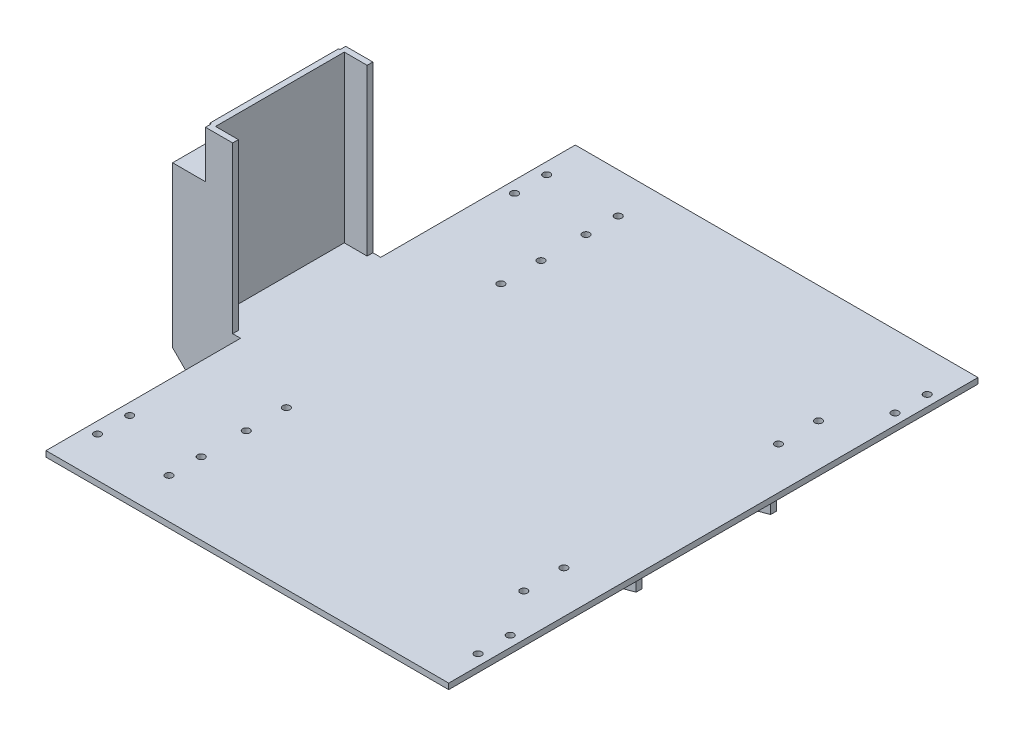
ISO-10303-21;
HEADER;
FILE_DESCRIPTION(('STEP AP214'),'2;1');
FILE_NAME('part.step','',(''),(''),'','','');
FILE_SCHEMA(('AUTOMOTIVE_DESIGN { 1 0 10303 214 1 1 1 1 }'));
ENDSEC;
DATA;
#1=APPLICATION_CONTEXT('core data for automotive mechanical design processes');
#2=APPLICATION_PROTOCOL_DEFINITION('international standard','automotive_design',2000,#1);
#3=PRODUCT_CONTEXT('',#1,'mechanical');
#4=PRODUCT('Part','Part','',(#3));
#5=PRODUCT_RELATED_PRODUCT_CATEGORY('part','',(#4));
#6=PRODUCT_DEFINITION_FORMATION('','',#4);
#7=PRODUCT_DEFINITION_CONTEXT('part definition',#1,'design');
#8=PRODUCT_DEFINITION('design','',#6,#7);
#9=PRODUCT_DEFINITION_SHAPE('','',#8);
#10=(LENGTH_UNIT() NAMED_UNIT(*) SI_UNIT(.MILLI.,.METRE.));
#11=(NAMED_UNIT(*) PLANE_ANGLE_UNIT() SI_UNIT($,.RADIAN.));
#12=(NAMED_UNIT(*) SI_UNIT($,.STERADIAN.) SOLID_ANGLE_UNIT());
#13=UNCERTAINTY_MEASURE_WITH_UNIT(LENGTH_MEASURE(1.E-05),#10,'distance_accuracy_value','');
#14=(GEOMETRIC_REPRESENTATION_CONTEXT(3) GLOBAL_UNCERTAINTY_ASSIGNED_CONTEXT((#13)) GLOBAL_UNIT_ASSIGNED_CONTEXT((#10,
#11,#12)) REPRESENTATION_CONTEXT('',''));
#15=CARTESIAN_POINT('',(0.,0.,0.));
#16=DIRECTION('',(0.,0.,1.));
#17=DIRECTION('',(1.,0.,0.));
#18=AXIS2_PLACEMENT_3D('',#15,#16,#17);
#19=CARTESIAN_POINT('',(21.9999999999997,-82.5,49.));
#20=DIRECTION('',(0.,1.,0.));
#21=DIRECTION('',(0.,0.,1.));
#22=AXIS2_PLACEMENT_3D('',#19,#20,#21);
#23=PLANE('',#22);
#24=CARTESIAN_POINT('',(55.5000000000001,-82.5,-157.));
#25=DIRECTION('',(0.,1.,0.));
#26=DIRECTION('',(0.,0.,1.));
#27=AXIS2_PLACEMENT_3D('',#24,#25,#26);
#28=CIRCLE('',#27,2.49999999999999);
#29=CARTESIAN_POINT('',(55.5000000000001,-82.5,-154.5));
#30=VERTEX_POINT('',#29);
#31=EDGE_CURVE('E868',#30,#30,#28,.T.);
#32=ORIENTED_EDGE('',*,*,#31,.F.);
#33=EDGE_LOOP('',(#32));
#34=FACE_BOUND('',#33,.T.);
#35=CARTESIAN_POINT('',(105.5,-82.5,-157.));
#36=DIRECTION('',(0.,1.,0.));
#37=DIRECTION('',(0.,0.,1.));
#38=AXIS2_PLACEMENT_3D('',#35,#36,#37);
#39=CIRCLE('',#38,2.49999999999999);
#40=CARTESIAN_POINT('',(105.5,-82.5,-154.5));
#41=VERTEX_POINT('',#40);
#42=EDGE_CURVE('E872',#41,#41,#39,.T.);
#43=ORIENTED_EDGE('',*,*,#42,.F.);
#44=EDGE_LOOP('',(#43));
#45=FACE_BOUND('',#44,.T.);
#46=CARTESIAN_POINT('',(105.5,-82.5,-134.5));
#47=DIRECTION('',(0.,1.,0.));
#48=DIRECTION('',(0.,0.,1.));
#49=AXIS2_PLACEMENT_3D('',#46,#47,#48);
#50=CIRCLE('',#49,2.49999999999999);
#51=CARTESIAN_POINT('',(105.5,-82.5,-132.));
#52=VERTEX_POINT('',#51);
#53=EDGE_CURVE('E878',#52,#52,#50,.T.);
#54=ORIENTED_EDGE('',*,*,#53,.F.);
#55=EDGE_LOOP('',(#54));
#56=FACE_BOUND('',#55,.T.);
#57=CARTESIAN_POINT('',(55.5000000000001,-82.5,-134.5));
#58=DIRECTION('',(0.,1.,0.));
#59=DIRECTION('',(0.,0.,1.));
#60=AXIS2_PLACEMENT_3D('',#57,#58,#59);
#61=CIRCLE('',#60,2.49999999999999);
#62=CARTESIAN_POINT('',(55.5000000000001,-82.5,-132.));
#63=VERTEX_POINT('',#62);
#64=EDGE_CURVE('E530',#63,#63,#61,.T.);
#65=ORIENTED_EDGE('',*,*,#64,.F.);
#66=EDGE_LOOP('',(#65));
#67=FACE_BOUND('',#66,.T.);
#68=CARTESIAN_POINT('',(105.5,-82.5,-103.));
#69=DIRECTION('',(0.,1.,0.));
#70=DIRECTION('',(0.,0.,1.));
#71=AXIS2_PLACEMENT_3D('',#68,#69,#70);
#72=CIRCLE('',#71,2.49999999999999);
#73=CARTESIAN_POINT('',(105.5,-82.5,-100.5));
#74=VERTEX_POINT('',#73);
#75=EDGE_CURVE('E518',#74,#74,#72,.T.);
#76=ORIENTED_EDGE('',*,*,#75,.F.);
#77=EDGE_LOOP('',(#76));
#78=FACE_BOUND('',#77,.T.);
#79=CARTESIAN_POINT('',(105.5,-82.5,-75.));
#80=DIRECTION('',(0.,1.,0.));
#81=DIRECTION('',(0.,0.,1.));
#82=AXIS2_PLACEMENT_3D('',#79,#80,#81);
#83=CIRCLE('',#82,2.49999999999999);
#84=CARTESIAN_POINT('',(105.5,-82.5,-72.5));
#85=VERTEX_POINT('',#84);
#86=EDGE_CURVE('E517',#85,#85,#83,.T.);
#87=ORIENTED_EDGE('',*,*,#86,.F.);
#88=EDGE_LOOP('',(#87));
#89=FACE_BOUND('',#88,.T.);
#90=CARTESIAN_POINT('',(299.5,-82.5,-75.));
#91=DIRECTION('',(0.,1.,0.));
#92=DIRECTION('',(0.,0.,1.));
#93=AXIS2_PLACEMENT_3D('',#90,#91,#92);
#94=CIRCLE('',#93,2.5);
#95=CARTESIAN_POINT('',(299.5,-82.5,-72.5));
#96=VERTEX_POINT('',#95);
#97=EDGE_CURVE('E536',#96,#96,#94,.T.);
#98=ORIENTED_EDGE('',*,*,#97,.F.);
#99=EDGE_LOOP('',(#98));
#100=FACE_BOUND('',#99,.T.);
#101=CARTESIAN_POINT('',(299.5,-82.5,-103.));
#102=DIRECTION('',(0.,1.,0.));
#103=DIRECTION('',(0.,0.,1.));
#104=AXIS2_PLACEMENT_3D('',#101,#102,#103);
#105=CIRCLE('',#104,2.5);
#106=CARTESIAN_POINT('',(299.5,-82.5,-100.5));
#107=VERTEX_POINT('',#106);
#108=EDGE_CURVE('E514',#107,#107,#105,.T.);
#109=ORIENTED_EDGE('',*,*,#108,.F.);
#110=EDGE_LOOP('',(#109));
#111=FACE_BOUND('',#110,.T.);
#112=CARTESIAN_POINT('',(321.5,-82.5,-134.5));
#113=DIRECTION('',(0.,1.,0.));
#114=DIRECTION('',(0.,0.,1.));
#115=AXIS2_PLACEMENT_3D('',#112,#113,#114);
#116=CIRCLE('',#115,2.5);
#117=CARTESIAN_POINT('',(321.5,-82.5,-132.));
#118=VERTEX_POINT('',#117);
#119=EDGE_CURVE('E511',#118,#118,#116,.T.);
#120=ORIENTED_EDGE('',*,*,#119,.F.);
#121=EDGE_LOOP('',(#120));
#122=FACE_BOUND('',#121,.T.);
#123=CARTESIAN_POINT('',(321.5,-82.5,-157.));
#124=DIRECTION('',(0.,1.,0.));
#125=DIRECTION('',(0.,0.,1.));
#126=AXIS2_PLACEMENT_3D('',#123,#124,#125);
#127=CIRCLE('',#126,2.5);
#128=CARTESIAN_POINT('',(321.5,-82.5,-154.5));
#129=VERTEX_POINT('',#128);
#130=EDGE_CURVE('E510',#129,#129,#127,.T.);
#131=ORIENTED_EDGE('',*,*,#130,.F.);
#132=EDGE_LOOP('',(#131));
#133=FACE_BOUND('',#132,.T.);
#134=CARTESIAN_POINT('',(299.5,-82.5,75.));
#135=DIRECTION('',(0.,1.,0.));
#136=DIRECTION('',(0.,0.,1.));
#137=AXIS2_PLACEMENT_3D('',#134,#135,#136);
#138=CIRCLE('',#137,2.5);
#139=CARTESIAN_POINT('',(299.5,-82.5,77.5));
#140=VERTEX_POINT('',#139);
#141=EDGE_CURVE('E551',#140,#140,#138,.T.);
#142=ORIENTED_EDGE('',*,*,#141,.F.);
#143=EDGE_LOOP('',(#142));
#144=FACE_BOUND('',#143,.T.);
#145=CARTESIAN_POINT('',(299.5,-82.5,103.));
#146=DIRECTION('',(0.,1.,0.));
#147=DIRECTION('',(0.,0.,1.));
#148=AXIS2_PLACEMENT_3D('',#145,#146,#147);
#149=CIRCLE('',#148,2.5);
#150=CARTESIAN_POINT('',(299.5,-82.5,105.5));
#151=VERTEX_POINT('',#150);
#152=EDGE_CURVE('E557',#151,#151,#149,.T.);
#153=ORIENTED_EDGE('',*,*,#152,.F.);
#154=EDGE_LOOP('',(#153));
#155=FACE_BOUND('',#154,.T.);
#156=CARTESIAN_POINT('',(321.5,-82.5,134.5));
#157=DIRECTION('',(0.,1.,0.));
#158=DIRECTION('',(0.,0.,1.));
#159=AXIS2_PLACEMENT_3D('',#156,#157,#158);
#160=CIRCLE('',#159,2.5);
#161=CARTESIAN_POINT('',(321.5,-82.5,137.));
#162=VERTEX_POINT('',#161);
#163=EDGE_CURVE('E563',#162,#162,#160,.T.);
#164=ORIENTED_EDGE('',*,*,#163,.F.);
#165=EDGE_LOOP('',(#164));
#166=FACE_BOUND('',#165,.T.);
#167=CARTESIAN_POINT('',(321.5,-82.5,157.));
#168=DIRECTION('',(0.,1.,0.));
#169=DIRECTION('',(0.,0.,1.));
#170=AXIS2_PLACEMENT_3D('',#167,#168,#169);
#171=CIRCLE('',#170,2.5);
#172=CARTESIAN_POINT('',(321.5,-82.5,159.5));
#173=VERTEX_POINT('',#172);
#174=EDGE_CURVE('E569',#173,#173,#171,.T.);
#175=ORIENTED_EDGE('',*,*,#174,.F.);
#176=EDGE_LOOP('',(#175));
#177=FACE_BOUND('',#176,.T.);
#178=CARTESIAN_POINT('',(105.5,-82.5,157.));
#179=DIRECTION('',(0.,1.,0.));
#180=DIRECTION('',(0.,0.,1.));
#181=AXIS2_PLACEMENT_3D('',#178,#179,#180);
#182=CIRCLE('',#181,2.49999999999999);
#183=CARTESIAN_POINT('',(105.5,-82.5,159.5));
#184=VERTEX_POINT('',#183);
#185=EDGE_CURVE('E575',#184,#184,#182,.T.);
#186=ORIENTED_EDGE('',*,*,#185,.F.);
#187=EDGE_LOOP('',(#186));
#188=FACE_BOUND('',#187,.T.);
#189=CARTESIAN_POINT('',(105.5,-82.5,134.5));
#190=DIRECTION('',(0.,1.,0.));
#191=DIRECTION('',(0.,0.,1.));
#192=AXIS2_PLACEMENT_3D('',#189,#190,#191);
#193=CIRCLE('',#192,2.49999999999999);
#194=CARTESIAN_POINT('',(105.5,-82.5,137.));
#195=VERTEX_POINT('',#194);
#196=EDGE_CURVE('E581',#195,#195,#193,.T.);
#197=ORIENTED_EDGE('',*,*,#196,.F.);
#198=EDGE_LOOP('',(#197));
#199=FACE_BOUND('',#198,.T.);
#200=CARTESIAN_POINT('',(105.5,-82.5,103.));
#201=DIRECTION('',(0.,1.,0.));
#202=DIRECTION('',(0.,0.,1.));
#203=AXIS2_PLACEMENT_3D('',#200,#201,#202);
#204=CIRCLE('',#203,2.49999999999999);
#205=CARTESIAN_POINT('',(105.5,-82.5,105.5));
#206=VERTEX_POINT('',#205);
#207=EDGE_CURVE('E587',#206,#206,#204,.T.);
#208=ORIENTED_EDGE('',*,*,#207,.F.);
#209=EDGE_LOOP('',(#208));
#210=FACE_BOUND('',#209,.T.);
#211=CARTESIAN_POINT('',(105.5,-82.5,75.));
#212=DIRECTION('',(0.,1.,0.));
#213=DIRECTION('',(0.,0.,1.));
#214=AXIS2_PLACEMENT_3D('',#211,#212,#213);
#215=CIRCLE('',#214,2.49999999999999);
#216=CARTESIAN_POINT('',(105.5,-82.5,77.5));
#217=VERTEX_POINT('',#216);
#218=EDGE_CURVE('E593',#217,#217,#215,.T.);
#219=ORIENTED_EDGE('',*,*,#218,.F.);
#220=EDGE_LOOP('',(#219));
#221=FACE_BOUND('',#220,.T.);
#222=CARTESIAN_POINT('',(55.5000000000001,-82.5,134.5));
#223=DIRECTION('',(0.,1.,0.));
#224=DIRECTION('',(0.,0.,1.));
#225=AXIS2_PLACEMENT_3D('',#222,#223,#224);
#226=CIRCLE('',#225,2.49999999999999);
#227=CARTESIAN_POINT('',(55.5000000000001,-82.5,137.));
#228=VERTEX_POINT('',#227);
#229=EDGE_CURVE('E599',#228,#228,#226,.T.);
#230=ORIENTED_EDGE('',*,*,#229,.F.);
#231=EDGE_LOOP('',(#230));
#232=FACE_BOUND('',#231,.T.);
#233=CARTESIAN_POINT('',(55.5000000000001,-82.5,157.));
#234=DIRECTION('',(0.,1.,0.));
#235=DIRECTION('',(0.,0.,1.));
#236=AXIS2_PLACEMENT_3D('',#233,#234,#235);
#237=CIRCLE('',#236,2.49999999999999);
#238=CARTESIAN_POINT('',(55.5000000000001,-82.5,159.5));
#239=VERTEX_POINT('',#238);
#240=EDGE_CURVE('E506',#239,#239,#237,.T.);
#241=ORIENTED_EDGE('',*,*,#240,.F.);
#242=EDGE_LOOP('',(#241));
#243=FACE_BOUND('',#242,.T.);
#244=DIRECTION('',(-1.,0.,0.));
#245=VECTOR('',#244,1.);
#246=CARTESIAN_POINT('',(21.9999999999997,-82.5,-45.));
#247=LINE('',#246,#245);
#248=CARTESIAN_POINT('',(42.,-82.5,-45.));
#249=VERTEX_POINT('',#248);
#250=CARTESIAN_POINT('',(26.,-82.5,-45.));
#251=VERTEX_POINT('',#250);
#252=EDGE_CURVE('E333',#249,#251,#247,.T.);
#253=ORIENTED_EDGE('',*,*,#252,.T.);
#254=DIRECTION('',(0.,0.,-1.));
#255=VECTOR('',#254,1.);
#256=CARTESIAN_POINT('',(26.,-82.5,-45.));
#257=LINE('',#256,#255);
#258=CARTESIAN_POINT('',(26.,-82.5,45.));
#259=VERTEX_POINT('',#258);
#260=EDGE_CURVE('E281',#259,#251,#257,.T.);
#261=ORIENTED_EDGE('',*,*,#260,.F.);
#262=DIRECTION('',(1.,0.,0.));
#263=VECTOR('',#262,1.);
#264=CARTESIAN_POINT('',(21.9999999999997,-82.5,45.));
#265=LINE('',#264,#263);
#266=CARTESIAN_POINT('',(42.,-82.5,45.));
#267=VERTEX_POINT('',#266);
#268=EDGE_CURVE('E416',#259,#267,#265,.T.);
#269=ORIENTED_EDGE('',*,*,#268,.T.);
#270=DIRECTION('',(0.,0.,1.));
#271=VECTOR('',#270,1.);
#272=CARTESIAN_POINT('',(42.,-82.5,45.));
#273=LINE('',#272,#271);
#274=CARTESIAN_POINT('',(42.,-82.5,49.));
#275=VERTEX_POINT('',#274);
#276=EDGE_CURVE('E404',#267,#275,#273,.T.);
#277=ORIENTED_EDGE('',*,*,#276,.T.);
#278=DIRECTION('',(1.,0.,0.));
#279=VECTOR('',#278,1.);
#280=CARTESIAN_POINT('',(21.9999999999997,-82.5,49.));
#281=LINE('',#280,#279);
#282=CARTESIAN_POINT('',(47.5000000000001,-82.5,49.));
#283=VERTEX_POINT('',#282);
#284=EDGE_CURVE('E456',#275,#283,#281,.T.);
#285=ORIENTED_EDGE('',*,*,#284,.T.);
#286=DIRECTION('',(0.,0.,1.));
#287=VECTOR('',#286,1.);
#288=CARTESIAN_POINT('',(47.5000000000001,-82.5,-185.));
#289=LINE('',#288,#287);
#290=CARTESIAN_POINT('',(47.5000000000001,-82.5,185.));
#291=VERTEX_POINT('',#290);
#292=EDGE_CURVE('E421',#283,#291,#289,.T.);
#293=ORIENTED_EDGE('',*,*,#292,.T.);
#294=DIRECTION('',(1.,0.,0.));
#295=VECTOR('',#294,1.);
#296=CARTESIAN_POINT('',(47.5000000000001,-82.5,185.));
#297=LINE('',#296,#295);
#298=CARTESIAN_POINT('',(329.,-82.5,185.));
#299=VERTEX_POINT('',#298);
#300=EDGE_CURVE('E436',#291,#299,#297,.T.);
#301=ORIENTED_EDGE('',*,*,#300,.T.);
#302=DIRECTION('',(0.,0.,-1.));
#303=VECTOR('',#302,1.);
#304=CARTESIAN_POINT('',(329.,-82.5,49.));
#305=LINE('',#304,#303);
#306=CARTESIAN_POINT('',(329.,-82.5,-185.));
#307=VERTEX_POINT('',#306);
#308=EDGE_CURVE('E480',#299,#307,#305,.T.);
#309=ORIENTED_EDGE('',*,*,#308,.T.);
#310=DIRECTION('',(-1.,0.,0.));
#311=VECTOR('',#310,1.);
#312=CARTESIAN_POINT('',(47.5000000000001,-82.5,-185.));
#313=LINE('',#312,#311);
#314=CARTESIAN_POINT('',(47.5000000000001,-82.5,-185.));
#315=VERTEX_POINT('',#314);
#316=EDGE_CURVE('E439',#307,#315,#313,.T.);
#317=ORIENTED_EDGE('',*,*,#316,.T.);
#318=CARTESIAN_POINT('',(47.5,-82.5,-49.));
#319=VERTEX_POINT('',#318);
#320=EDGE_CURVE('E433',#315,#319,#289,.T.);
#321=ORIENTED_EDGE('',*,*,#320,.T.);
#322=DIRECTION('',(1.,0.,0.));
#323=VECTOR('',#322,1.);
#324=CARTESIAN_POINT('',(21.9999999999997,-82.5,-49.));
#325=LINE('',#324,#323);
#326=CARTESIAN_POINT('',(42.,-82.5,-49.));
#327=VERTEX_POINT('',#326);
#328=EDGE_CURVE('E455',#327,#319,#325,.T.);
#329=ORIENTED_EDGE('',*,*,#328,.F.);
#330=DIRECTION('',(0.,0.,-1.));
#331=VECTOR('',#330,1.);
#332=CARTESIAN_POINT('',(42.,-82.5,-45.));
#333=LINE('',#332,#331);
#334=EDGE_CURVE('E334',#249,#327,#333,.T.);
#335=ORIENTED_EDGE('',*,*,#334,.F.);
#336=EDGE_LOOP('',(#253,#261,#269,#277,#285,#293,#301,#309,#317,#321,#329,#335));
#337=FACE_BOUND('',#336,.T.);
#338=ADVANCED_FACE('F40',(#34,#45,#56,#67,#78,#89,#100,#111,#122,#133,#144,#155,#166,#177,#188,
#199,#210,#221,#232,#243,#337),#23,.T.);
#339=CARTESIAN_POINT('',(0.,0.,45.));
#340=DIRECTION('',(0.,0.,1.));
#341=DIRECTION('',(1.,0.,0.));
#342=AXIS2_PLACEMENT_3D('',#339,#340,#341);
#343=PLANE('',#342);
#344=DIRECTION('',(0.,-1.,0.));
#345=VECTOR('',#344,1.);
#346=CARTESIAN_POINT('',(26.,123.088845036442,45.));
#347=LINE('',#346,#345);
#348=CARTESIAN_POINT('',(26.,33.,45.));
#349=VERTEX_POINT('',#348);
#350=EDGE_CURVE('E267',#349,#259,#347,.T.);
#351=ORIENTED_EDGE('',*,*,#350,.F.);
#352=DIRECTION('',(-1.,0.,0.));
#353=VECTOR('',#352,1.);
#354=CARTESIAN_POINT('',(42.,33.,45.));
#355=LINE('',#354,#353);
#356=CARTESIAN_POINT('',(42.,33.,45.));
#357=VERTEX_POINT('',#356);
#358=EDGE_CURVE('E377',#357,#349,#355,.T.);
#359=ORIENTED_EDGE('',*,*,#358,.F.);
#360=DIRECTION('',(0.,1.,0.));
#361=VECTOR('',#360,1.);
#362=CARTESIAN_POINT('',(42.,-82.5,45.));
#363=LINE('',#362,#361);
#364=EDGE_CURVE('E374',#267,#357,#363,.T.);
#365=ORIENTED_EDGE('',*,*,#364,.F.);
#366=ORIENTED_EDGE('',*,*,#268,.F.);
#367=EDGE_LOOP('',(#351,#359,#365,#366));
#368=FACE_BOUND('',#367,.T.);
#369=ADVANCED_FACE('F652',(#368),#343,.F.);
#370=CARTESIAN_POINT('',(324.,-126.5,-45.));
#371=DIRECTION('',(0.,0.,-1.));
#372=DIRECTION('',(-1.,0.,0.));
#373=AXIS2_PLACEMENT_3D('',#370,#371,#372);
#374=PLANE('',#373);
#375=DIRECTION('',(0.,-1.,0.));
#376=VECTOR('',#375,1.);
#377=CARTESIAN_POINT('',(26.,123.088845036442,-45.));
#378=LINE('',#377,#376);
#379=CARTESIAN_POINT('',(26.,33.,-45.));
#380=VERTEX_POINT('',#379);
#381=EDGE_CURVE('E276',#380,#251,#378,.T.);
#382=ORIENTED_EDGE('',*,*,#381,.T.);
#383=ORIENTED_EDGE('',*,*,#252,.F.);
#384=DIRECTION('',(0.,-1.,0.));
#385=VECTOR('',#384,1.);
#386=CARTESIAN_POINT('',(42.,33.,-45.));
#387=LINE('',#386,#385);
#388=CARTESIAN_POINT('',(42.,33.,-45.));
#389=VERTEX_POINT('',#388);
#390=EDGE_CURVE('E307',#389,#249,#387,.T.);
#391=ORIENTED_EDGE('',*,*,#390,.F.);
#392=DIRECTION('',(1.,0.,0.));
#393=VECTOR('',#392,1.);
#394=CARTESIAN_POINT('',(23.,33.,-45.));
#395=LINE('',#394,#393);
#396=EDGE_CURVE('E305',#380,#389,#395,.T.);
#397=ORIENTED_EDGE('',*,*,#396,.F.);
#398=EDGE_LOOP('',(#382,#383,#391,#397));
#399=FACE_BOUND('',#398,.T.);
#400=ADVANCED_FACE('F615',(#399),#374,.F.);
#401=CARTESIAN_POINT('',(21.9999999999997,-86.5,49.));
#402=DIRECTION('',(0.,1.,0.));
#403=DIRECTION('',(0.,0.,1.));
#404=AXIS2_PLACEMENT_3D('',#401,#402,#403);
#405=PLANE('',#404);
#406=CARTESIAN_POINT('',(55.5000000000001,-86.5,-157.));
#407=DIRECTION('',(0.,1.,0.));
#408=DIRECTION('',(0.,0.,1.));
#409=AXIS2_PLACEMENT_3D('',#406,#407,#408);
#410=CIRCLE('',#409,2.49999999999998);
#411=CARTESIAN_POINT('',(55.5000000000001,-86.5,-154.5));
#412=VERTEX_POINT('',#411);
#413=EDGE_CURVE('E871',#412,#412,#410,.T.);
#414=ORIENTED_EDGE('',*,*,#413,.T.);
#415=EDGE_LOOP('',(#414));
#416=FACE_BOUND('',#415,.T.);
#417=CARTESIAN_POINT('',(105.5,-86.5,-157.));
#418=DIRECTION('',(0.,1.,0.));
#419=DIRECTION('',(0.,0.,1.));
#420=AXIS2_PLACEMENT_3D('',#417,#418,#419);
#421=CIRCLE('',#420,2.49999999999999);
#422=CARTESIAN_POINT('',(105.5,-86.5,-154.5));
#423=VERTEX_POINT('',#422);
#424=EDGE_CURVE('E44',#423,#423,#421,.T.);
#425=ORIENTED_EDGE('',*,*,#424,.T.);
#426=EDGE_LOOP('',(#425));
#427=FACE_BOUND('',#426,.T.);
#428=CARTESIAN_POINT('',(105.5,-86.5,-134.5));
#429=DIRECTION('',(0.,1.,0.));
#430=DIRECTION('',(0.,0.,1.));
#431=AXIS2_PLACEMENT_3D('',#428,#429,#430);
#432=CIRCLE('',#431,2.49999999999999);
#433=CARTESIAN_POINT('',(105.5,-86.5,-132.));
#434=VERTEX_POINT('',#433);
#435=EDGE_CURVE('E881',#434,#434,#432,.T.);
#436=ORIENTED_EDGE('',*,*,#435,.T.);
#437=EDGE_LOOP('',(#436));
#438=FACE_BOUND('',#437,.T.);
#439=CARTESIAN_POINT('',(55.5000000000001,-86.5,-134.5));
#440=DIRECTION('',(0.,1.,0.));
#441=DIRECTION('',(0.,0.,1.));
#442=AXIS2_PLACEMENT_3D('',#439,#440,#441);
#443=CIRCLE('',#442,2.49999999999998);
#444=CARTESIAN_POINT('',(55.5000000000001,-86.5,-132.));
#445=VERTEX_POINT('',#444);
#446=EDGE_CURVE('E525',#445,#445,#443,.T.);
#447=ORIENTED_EDGE('',*,*,#446,.T.);
#448=EDGE_LOOP('',(#447));
#449=FACE_BOUND('',#448,.T.);
#450=CARTESIAN_POINT('',(105.5,-86.5,-103.));
#451=DIRECTION('',(0.,1.,0.));
#452=DIRECTION('',(0.,0.,1.));
#453=AXIS2_PLACEMENT_3D('',#450,#451,#452);
#454=CIRCLE('',#453,2.49999999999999);
#455=CARTESIAN_POINT('',(105.5,-86.5,-100.5));
#456=VERTEX_POINT('',#455);
#457=EDGE_CURVE('E515',#456,#456,#454,.T.);
#458=ORIENTED_EDGE('',*,*,#457,.T.);
#459=EDGE_LOOP('',(#458));
#460=FACE_BOUND('',#459,.T.);
#461=CARTESIAN_POINT('',(105.5,-86.5,-75.));
#462=DIRECTION('',(0.,1.,0.));
#463=DIRECTION('',(0.,0.,1.));
#464=AXIS2_PLACEMENT_3D('',#461,#462,#463);
#465=CIRCLE('',#464,2.49999999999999);
#466=CARTESIAN_POINT('',(105.5,-86.5,-72.5));
#467=VERTEX_POINT('',#466);
#468=EDGE_CURVE('E522',#467,#467,#465,.T.);
#469=ORIENTED_EDGE('',*,*,#468,.T.);
#470=EDGE_LOOP('',(#469));
#471=FACE_BOUND('',#470,.T.);
#472=CARTESIAN_POINT('',(299.5,-86.5,-75.));
#473=DIRECTION('',(0.,1.,0.));
#474=DIRECTION('',(0.,0.,1.));
#475=AXIS2_PLACEMENT_3D('',#472,#473,#474);
#476=CIRCLE('',#475,2.5);
#477=CARTESIAN_POINT('',(299.5,-86.5,-72.5));
#478=VERTEX_POINT('',#477);
#479=EDGE_CURVE('E539',#478,#478,#476,.T.);
#480=ORIENTED_EDGE('',*,*,#479,.T.);
#481=EDGE_LOOP('',(#480));
#482=FACE_BOUND('',#481,.T.);
#483=CARTESIAN_POINT('',(299.5,-86.5,-103.));
#484=DIRECTION('',(0.,1.,0.));
#485=DIRECTION('',(0.,0.,1.));
#486=AXIS2_PLACEMENT_3D('',#483,#484,#485);
#487=CIRCLE('',#486,2.5);
#488=CARTESIAN_POINT('',(299.5,-86.5,-100.5));
#489=VERTEX_POINT('',#488);
#490=EDGE_CURVE('E512',#489,#489,#487,.T.);
#491=ORIENTED_EDGE('',*,*,#490,.T.);
#492=EDGE_LOOP('',(#491));
#493=FACE_BOUND('',#492,.T.);
#494=CARTESIAN_POINT('',(321.5,-86.5,-134.5));
#495=DIRECTION('',(0.,1.,0.));
#496=DIRECTION('',(0.,0.,1.));
#497=AXIS2_PLACEMENT_3D('',#494,#495,#496);
#498=CIRCLE('',#497,2.5);
#499=CARTESIAN_POINT('',(321.5,-86.5,-132.));
#500=VERTEX_POINT('',#499);
#501=EDGE_CURVE('E507',#500,#500,#498,.T.);
#502=ORIENTED_EDGE('',*,*,#501,.T.);
#503=EDGE_LOOP('',(#502));
#504=FACE_BOUND('',#503,.T.);
#505=CARTESIAN_POINT('',(321.5,-86.5,-157.));
#506=DIRECTION('',(0.,1.,0.));
#507=DIRECTION('',(0.,0.,1.));
#508=AXIS2_PLACEMENT_3D('',#505,#506,#507);
#509=CIRCLE('',#508,2.5);
#510=CARTESIAN_POINT('',(321.5,-86.5,-154.5));
#511=VERTEX_POINT('',#510);
#512=EDGE_CURVE('E548',#511,#511,#509,.T.);
#513=ORIENTED_EDGE('',*,*,#512,.T.);
#514=EDGE_LOOP('',(#513));
#515=FACE_BOUND('',#514,.T.);
#516=CARTESIAN_POINT('',(299.5,-86.5,75.));
#517=DIRECTION('',(0.,1.,0.));
#518=DIRECTION('',(0.,0.,1.));
#519=AXIS2_PLACEMENT_3D('',#516,#517,#518);
#520=CIRCLE('',#519,2.5);
#521=CARTESIAN_POINT('',(299.5,-86.5,77.5));
#522=VERTEX_POINT('',#521);
#523=EDGE_CURVE('E554',#522,#522,#520,.T.);
#524=ORIENTED_EDGE('',*,*,#523,.T.);
#525=EDGE_LOOP('',(#524));
#526=FACE_BOUND('',#525,.T.);
#527=CARTESIAN_POINT('',(299.5,-86.5,103.));
#528=DIRECTION('',(0.,1.,0.));
#529=DIRECTION('',(0.,0.,1.));
#530=AXIS2_PLACEMENT_3D('',#527,#528,#529);
#531=CIRCLE('',#530,2.5);
#532=CARTESIAN_POINT('',(299.5,-86.5,105.5));
#533=VERTEX_POINT('',#532);
#534=EDGE_CURVE('E560',#533,#533,#531,.T.);
#535=ORIENTED_EDGE('',*,*,#534,.T.);
#536=EDGE_LOOP('',(#535));
#537=FACE_BOUND('',#536,.T.);
#538=CARTESIAN_POINT('',(321.5,-86.5,134.5));
#539=DIRECTION('',(0.,1.,0.));
#540=DIRECTION('',(0.,0.,1.));
#541=AXIS2_PLACEMENT_3D('',#538,#539,#540);
#542=CIRCLE('',#541,2.5);
#543=CARTESIAN_POINT('',(321.5,-86.5,137.));
#544=VERTEX_POINT('',#543);
#545=EDGE_CURVE('E566',#544,#544,#542,.T.);
#546=ORIENTED_EDGE('',*,*,#545,.T.);
#547=EDGE_LOOP('',(#546));
#548=FACE_BOUND('',#547,.T.);
#549=CARTESIAN_POINT('',(321.5,-86.5,157.));
#550=DIRECTION('',(0.,1.,0.));
#551=DIRECTION('',(0.,0.,1.));
#552=AXIS2_PLACEMENT_3D('',#549,#550,#551);
#553=CIRCLE('',#552,2.5);
#554=CARTESIAN_POINT('',(321.5,-86.5,159.5));
#555=VERTEX_POINT('',#554);
#556=EDGE_CURVE('E572',#555,#555,#553,.T.);
#557=ORIENTED_EDGE('',*,*,#556,.T.);
#558=EDGE_LOOP('',(#557));
#559=FACE_BOUND('',#558,.T.);
#560=CARTESIAN_POINT('',(105.5,-86.5,157.));
#561=DIRECTION('',(0.,1.,0.));
#562=DIRECTION('',(0.,0.,1.));
#563=AXIS2_PLACEMENT_3D('',#560,#561,#562);
#564=CIRCLE('',#563,2.49999999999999);
#565=CARTESIAN_POINT('',(105.5,-86.5,159.5));
#566=VERTEX_POINT('',#565);
#567=EDGE_CURVE('E578',#566,#566,#564,.T.);
#568=ORIENTED_EDGE('',*,*,#567,.T.);
#569=EDGE_LOOP('',(#568));
#570=FACE_BOUND('',#569,.T.);
#571=CARTESIAN_POINT('',(105.5,-86.5,134.5));
#572=DIRECTION('',(0.,1.,0.));
#573=DIRECTION('',(0.,0.,1.));
#574=AXIS2_PLACEMENT_3D('',#571,#572,#573);
#575=CIRCLE('',#574,2.49999999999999);
#576=CARTESIAN_POINT('',(105.5,-86.5,137.));
#577=VERTEX_POINT('',#576);
#578=EDGE_CURVE('E584',#577,#577,#575,.T.);
#579=ORIENTED_EDGE('',*,*,#578,.T.);
#580=EDGE_LOOP('',(#579));
#581=FACE_BOUND('',#580,.T.);
#582=CARTESIAN_POINT('',(105.5,-86.5,103.));
#583=DIRECTION('',(0.,1.,0.));
#584=DIRECTION('',(0.,0.,1.));
#585=AXIS2_PLACEMENT_3D('',#582,#583,#584);
#586=CIRCLE('',#585,2.49999999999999);
#587=CARTESIAN_POINT('',(105.5,-86.5,105.5));
#588=VERTEX_POINT('',#587);
#589=EDGE_CURVE('E590',#588,#588,#586,.T.);
#590=ORIENTED_EDGE('',*,*,#589,.T.);
#591=EDGE_LOOP('',(#590));
#592=FACE_BOUND('',#591,.T.);
#593=CARTESIAN_POINT('',(105.5,-86.5,75.));
#594=DIRECTION('',(0.,1.,0.));
#595=DIRECTION('',(0.,0.,1.));
#596=AXIS2_PLACEMENT_3D('',#593,#594,#595);
#597=CIRCLE('',#596,2.49999999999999);
#598=CARTESIAN_POINT('',(105.5,-86.5,77.5));
#599=VERTEX_POINT('',#598);
#600=EDGE_CURVE('E596',#599,#599,#597,.T.);
#601=ORIENTED_EDGE('',*,*,#600,.T.);
#602=EDGE_LOOP('',(#601));
#603=FACE_BOUND('',#602,.T.);
#604=CARTESIAN_POINT('',(55.5000000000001,-86.5,134.5));
#605=DIRECTION('',(0.,1.,0.));
#606=DIRECTION('',(0.,0.,1.));
#607=AXIS2_PLACEMENT_3D('',#604,#605,#606);
#608=CIRCLE('',#607,2.49999999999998);
#609=CARTESIAN_POINT('',(55.5000000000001,-86.5,137.));
#610=VERTEX_POINT('',#609);
#611=EDGE_CURVE('E602',#610,#610,#608,.T.);
#612=ORIENTED_EDGE('',*,*,#611,.T.);
#613=EDGE_LOOP('',(#612));
#614=FACE_BOUND('',#613,.T.);
#615=CARTESIAN_POINT('',(55.5000000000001,-86.5,157.));
#616=DIRECTION('',(0.,1.,0.));
#617=DIRECTION('',(0.,0.,1.));
#618=AXIS2_PLACEMENT_3D('',#615,#616,#617);
#619=CIRCLE('',#618,2.49999999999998);
#620=CARTESIAN_POINT('',(55.5000000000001,-86.5,159.5));
#621=VERTEX_POINT('',#620);
#622=EDGE_CURVE('E285',#621,#621,#619,.T.);
#623=ORIENTED_EDGE('',*,*,#622,.T.);
#624=EDGE_LOOP('',(#623));
#625=FACE_BOUND('',#624,.T.);
#626=DIRECTION('',(-1.,0.,0.));
#627=VECTOR('',#626,1.);
#628=CARTESIAN_POINT('',(21.9999999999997,-86.5,-45.));
#629=LINE('',#628,#627);
#630=CARTESIAN_POINT('',(324.,-86.5,-45.));
#631=VERTEX_POINT('',#630);
#632=CARTESIAN_POINT('',(17.9999999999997,-86.5,-45.));
#633=VERTEX_POINT('',#632);
#634=EDGE_CURVE('E355',#631,#633,#629,.T.);
#635=ORIENTED_EDGE('',*,*,#634,.F.);
#636=DIRECTION('',(0.,0.,-1.));
#637=VECTOR('',#636,1.);
#638=CARTESIAN_POINT('',(324.,-86.5,-45.));
#639=LINE('',#638,#637);
#640=CARTESIAN_POINT('',(324.,-86.5,-49.));
#641=VERTEX_POINT('',#640);
#642=EDGE_CURVE('E331',#631,#641,#639,.T.);
#643=ORIENTED_EDGE('',*,*,#642,.T.);
#644=DIRECTION('',(1.,0.,0.));
#645=VECTOR('',#644,1.);
#646=CARTESIAN_POINT('',(47.5000000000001,-86.5,-49.));
#647=LINE('',#646,#645);
#648=CARTESIAN_POINT('',(47.5,-86.5,-49.));
#649=VERTEX_POINT('',#648);
#650=EDGE_CURVE('E290',#649,#641,#647,.T.);
#651=ORIENTED_EDGE('',*,*,#650,.F.);
#652=DIRECTION('',(0.,0.,1.));
#653=VECTOR('',#652,1.);
#654=CARTESIAN_POINT('',(47.5000000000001,-86.5,-185.));
#655=LINE('',#654,#653);
#656=CARTESIAN_POINT('',(47.5000000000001,-86.5,-185.));
#657=VERTEX_POINT('',#656);
#658=EDGE_CURVE('E422',#657,#649,#655,.T.);
#659=ORIENTED_EDGE('',*,*,#658,.F.);
#660=DIRECTION('',(-1.,0.,0.));
#661=VECTOR('',#660,1.);
#662=CARTESIAN_POINT('',(47.5000000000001,-86.5,-185.));
#663=LINE('',#662,#661);
#664=CARTESIAN_POINT('',(329.,-86.5,-185.));
#665=VERTEX_POINT('',#664);
#666=EDGE_CURVE('E429',#665,#657,#663,.T.);
#667=ORIENTED_EDGE('',*,*,#666,.F.);
#668=DIRECTION('',(0.,0.,-1.));
#669=VECTOR('',#668,1.);
#670=CARTESIAN_POINT('',(329.,-86.5,49.));
#671=LINE('',#670,#669);
#672=CARTESIAN_POINT('',(329.,-86.5,185.));
#673=VERTEX_POINT('',#672);
#674=EDGE_CURVE('E482',#673,#665,#671,.T.);
#675=ORIENTED_EDGE('',*,*,#674,.F.);
#676=DIRECTION('',(1.,0.,0.));
#677=VECTOR('',#676,1.);
#678=CARTESIAN_POINT('',(47.5000000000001,-86.5,185.));
#679=LINE('',#678,#677);
#680=CARTESIAN_POINT('',(47.5000000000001,-86.5,185.));
#681=VERTEX_POINT('',#680);
#682=EDGE_CURVE('E425',#681,#673,#679,.T.);
#683=ORIENTED_EDGE('',*,*,#682,.F.);
#684=CARTESIAN_POINT('',(47.5000000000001,-86.5,49.));
#685=VERTEX_POINT('',#684);
#686=EDGE_CURVE('E426',#685,#681,#655,.T.);
#687=ORIENTED_EDGE('',*,*,#686,.F.);
#688=DIRECTION('',(1.,0.,0.));
#689=VECTOR('',#688,1.);
#690=CARTESIAN_POINT('',(21.9999999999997,-86.5,49.));
#691=LINE('',#690,#689);
#692=CARTESIAN_POINT('',(324.,-86.5,49.));
#693=VERTEX_POINT('',#692);
#694=EDGE_CURVE('E399',#685,#693,#691,.T.);
#695=ORIENTED_EDGE('',*,*,#694,.T.);
#696=DIRECTION('',(0.,0.,-1.));
#697=VECTOR('',#696,1.);
#698=CARTESIAN_POINT('',(324.,-86.5,49.));
#699=LINE('',#698,#697);
#700=CARTESIAN_POINT('',(324.,-86.5,45.));
#701=VERTEX_POINT('',#700);
#702=EDGE_CURVE('E418',#693,#701,#699,.T.);
#703=ORIENTED_EDGE('',*,*,#702,.T.);
#704=DIRECTION('',(1.,0.,0.));
#705=VECTOR('',#704,1.);
#706=CARTESIAN_POINT('',(21.9999999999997,-86.5,45.));
#707=LINE('',#706,#705);
#708=CARTESIAN_POINT('',(17.9999999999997,-86.5,45.));
#709=VERTEX_POINT('',#708);
#710=EDGE_CURVE('E414',#709,#701,#707,.T.);
#711=ORIENTED_EDGE('',*,*,#710,.F.);
#712=DIRECTION('',(0.,0.,-1.));
#713=VECTOR('',#712,1.);
#714=CARTESIAN_POINT('',(17.9999999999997,-86.5,49.));
#715=LINE('',#714,#713);
#716=EDGE_CURVE('E463',#709,#633,#715,.T.);
#717=ORIENTED_EDGE('',*,*,#716,.T.);
#718=EDGE_LOOP('',(#635,#643,#651,#659,#667,#675,#683,#687,#695,#703,#711,#717));
#719=FACE_BOUND('',#718,.T.);
#720=ADVANCED_FACE('F662',(#416,#427,#438,#449,#460,#471,#482,#493,#504,#515,#526,#537,#548,
#559,#570,#581,#592,#603,#614,#625,#719),#405,.F.);
#721=CARTESIAN_POINT('',(0.,-4.,49.));
#722=DIRECTION('',(0.,1.,0.));
#723=DIRECTION('',(0.,0.,1.));
#724=AXIS2_PLACEMENT_3D('',#721,#722,#723);
#725=PLANE('',#724);
#726=DIRECTION('',(-1.,0.,0.));
#727=VECTOR('',#726,1.);
#728=CARTESIAN_POINT('',(0.,-4.,-45.));
#729=LINE('',#728,#727);
#730=CARTESIAN_POINT('',(18.,-4.,-45.));
#731=VERTEX_POINT('',#730);
#732=CARTESIAN_POINT('',(0.,-4.,-45.));
#733=VERTEX_POINT('',#732);
#734=EDGE_CURVE('E352',#731,#733,#729,.T.);
#735=ORIENTED_EDGE('',*,*,#734,.F.);
#736=DIRECTION('',(0.,0.,-1.));
#737=VECTOR('',#736,1.);
#738=CARTESIAN_POINT('',(18.,-4.,49.));
#739=LINE('',#738,#737);
#740=CARTESIAN_POINT('',(18.,-4.,45.));
#741=VERTEX_POINT('',#740);
#742=EDGE_CURVE('E470',#741,#731,#739,.T.);
#743=ORIENTED_EDGE('',*,*,#742,.F.);
#744=DIRECTION('',(1.,0.,0.));
#745=VECTOR('',#744,1.);
#746=CARTESIAN_POINT('',(0.,-4.,45.));
#747=LINE('',#746,#745);
#748=CARTESIAN_POINT('',(0.,-4.,45.));
#749=VERTEX_POINT('',#748);
#750=EDGE_CURVE('E412',#749,#741,#747,.T.);
#751=ORIENTED_EDGE('',*,*,#750,.F.);
#752=DIRECTION('',(0.,0.,-1.));
#753=VECTOR('',#752,1.);
#754=CARTESIAN_POINT('',(0.,-4.,49.));
#755=LINE('',#754,#753);
#756=EDGE_CURVE('E473',#749,#733,#755,.T.);
#757=ORIENTED_EDGE('',*,*,#756,.T.);
#758=EDGE_LOOP('',(#735,#743,#751,#757));
#759=FACE_BOUND('',#758,.T.);
#760=ADVANCED_FACE('F707',(#759),#725,.F.);
#761=CARTESIAN_POINT('',(18.,0.,49.));
#762=DIRECTION('',(1.,0.,0.));
#763=DIRECTION('',(0.,1.,0.));
#764=AXIS2_PLACEMENT_3D('',#761,#762,#763);
#765=PLANE('',#764);
#766=DIRECTION('',(0.,1.,0.));
#767=VECTOR('',#766,1.);
#768=CARTESIAN_POINT('',(18.,0.,-45.));
#769=LINE('',#768,#767);
#770=EDGE_CURVE('E349',#633,#731,#769,.T.);
#771=ORIENTED_EDGE('',*,*,#770,.F.);
#772=ORIENTED_EDGE('',*,*,#716,.F.);
#773=DIRECTION('',(0.,-1.,0.));
#774=VECTOR('',#773,1.);
#775=CARTESIAN_POINT('',(18.,0.,45.));
#776=LINE('',#775,#774);
#777=EDGE_CURVE('E487',#741,#709,#776,.T.);
#778=ORIENTED_EDGE('',*,*,#777,.F.);
#779=ORIENTED_EDGE('',*,*,#742,.T.);
#780=EDGE_LOOP('',(#771,#772,#778,#779));
#781=FACE_BOUND('',#780,.T.);
#782=ADVANCED_FACE('F711',(#781),#765,.F.);
#783=CARTESIAN_POINT('',(329.,-82.5,49.));
#784=DIRECTION('',(1.,0.,0.));
#785=DIRECTION('',(0.,0.,-1.));
#786=AXIS2_PLACEMENT_3D('',#783,#784,#785);
#787=PLANE('',#786);
#788=ORIENTED_EDGE('',*,*,#674,.T.);
#789=DIRECTION('',(0.,1.,0.));
#790=VECTOR('',#789,1.);
#791=CARTESIAN_POINT('',(329.,-86.5,-185.));
#792=LINE('',#791,#790);
#793=EDGE_CURVE('E445',#665,#307,#792,.T.);
#794=ORIENTED_EDGE('',*,*,#793,.T.);
#795=ORIENTED_EDGE('',*,*,#308,.F.);
#796=DIRECTION('',(0.,1.,0.));
#797=VECTOR('',#796,1.);
#798=CARTESIAN_POINT('',(329.,-86.5,185.));
#799=LINE('',#798,#797);
#800=EDGE_CURVE('E448',#673,#299,#799,.T.);
#801=ORIENTED_EDGE('',*,*,#800,.F.);
#802=EDGE_LOOP('',(#788,#794,#795,#801));
#803=FACE_BOUND('',#802,.T.);
#804=ADVANCED_FACE('F671',(#803),#787,.T.);
#805=CARTESIAN_POINT('',(0.,0.,49.));
#806=DIRECTION('',(0.,1.,0.));
#807=DIRECTION('',(0.,0.,1.));
#808=AXIS2_PLACEMENT_3D('',#805,#806,#807);
#809=PLANE('',#808);
#810=DIRECTION('',(1.,0.,0.));
#811=VECTOR('',#810,1.);
#812=CARTESIAN_POINT('',(0.,0.,-49.));
#813=LINE('',#812,#811);
#814=CARTESIAN_POINT('',(0.,0.,-49.));
#815=VERTEX_POINT('',#814);
#816=CARTESIAN_POINT('',(23.,0.,-49.));
#817=VERTEX_POINT('',#816);
#818=EDGE_CURVE('E465',#815,#817,#813,.T.);
#819=ORIENTED_EDGE('',*,*,#818,.F.);
#820=DIRECTION('',(0.,0.,-1.));
#821=VECTOR('',#820,1.);
#822=CARTESIAN_POINT('',(0.,0.,49.));
#823=LINE('',#822,#821);
#824=CARTESIAN_POINT('',(0.,0.,49.));
#825=VERTEX_POINT('',#824);
#826=EDGE_CURVE('E476',#825,#815,#823,.T.);
#827=ORIENTED_EDGE('',*,*,#826,.F.);
#828=DIRECTION('',(1.,0.,0.));
#829=VECTOR('',#828,1.);
#830=CARTESIAN_POINT('',(0.,0.,49.));
#831=LINE('',#830,#829);
#832=CARTESIAN_POINT('',(23.,0.,49.));
#833=VERTEX_POINT('',#832);
#834=EDGE_CURVE('E458',#825,#833,#831,.T.);
#835=ORIENTED_EDGE('',*,*,#834,.T.);
#836=DIRECTION('',(0.,0.,1.));
#837=VECTOR('',#836,1.);
#838=CARTESIAN_POINT('',(23.,0.,45.));
#839=LINE('',#838,#837);
#840=CARTESIAN_POINT('',(23.,0.,45.));
#841=VERTEX_POINT('',#840);
#842=EDGE_CURVE('E396',#841,#833,#839,.T.);
#843=ORIENTED_EDGE('',*,*,#842,.F.);
#844=DIRECTION('',(-1.,0.,0.));
#845=VECTOR('',#844,1.);
#846=CARTESIAN_POINT('',(23.,0.,45.));
#847=LINE('',#846,#845);
#848=CARTESIAN_POINT('',(22.,0.,45.));
#849=VERTEX_POINT('',#848);
#850=EDGE_CURVE('E360',#841,#849,#847,.T.);
#851=ORIENTED_EDGE('',*,*,#850,.T.);
#852=DIRECTION('',(0.,0.,-1.));
#853=VECTOR('',#852,1.);
#854=CARTESIAN_POINT('',(22.,0.,49.));
#855=LINE('',#854,#853);
#856=CARTESIAN_POINT('',(22.,0.,-45.));
#857=VERTEX_POINT('',#856);
#858=EDGE_CURVE('E266',#849,#857,#855,.T.);
#859=ORIENTED_EDGE('',*,*,#858,.T.);
#860=DIRECTION('',(1.,0.,0.));
#861=VECTOR('',#860,1.);
#862=CARTESIAN_POINT('',(0.,0.,-45.));
#863=LINE('',#862,#861);
#864=CARTESIAN_POINT('',(23.,0.,-45.));
#865=VERTEX_POINT('',#864);
#866=EDGE_CURVE('E299',#857,#865,#863,.T.);
#867=ORIENTED_EDGE('',*,*,#866,.T.);
#868=DIRECTION('',(0.,0.,-1.));
#869=VECTOR('',#868,1.);
#870=CARTESIAN_POINT('',(23.,0.,-45.));
#871=LINE('',#870,#869);
#872=EDGE_CURVE('E341',#865,#817,#871,.T.);
#873=ORIENTED_EDGE('',*,*,#872,.T.);
#874=EDGE_LOOP('',(#819,#827,#835,#843,#851,#859,#867,#873));
#875=FACE_BOUND('',#874,.T.);
#876=ADVANCED_FACE('F634',(#875),#809,.T.);
#877=CARTESIAN_POINT('',(0.,-4.,49.));
#878=DIRECTION('',(-1.,0.,0.));
#879=DIRECTION('',(0.,0.,1.));
#880=AXIS2_PLACEMENT_3D('',#877,#878,#879);
#881=PLANE('',#880);
#882=DIRECTION('',(0.,1.,0.));
#883=VECTOR('',#882,1.);
#884=CARTESIAN_POINT('',(0.,-4.,-49.));
#885=LINE('',#884,#883);
#886=CARTESIAN_POINT('',(0.,-112.,-49.));
#887=VERTEX_POINT('',#886);
#888=EDGE_CURVE('E459',#887,#815,#885,.T.);
#889=ORIENTED_EDGE('',*,*,#888,.F.);
#890=DIRECTION('',(0.,0.,1.));
#891=VECTOR('',#890,1.);
#892=CARTESIAN_POINT('',(0.,-112.,49.));
#893=LINE('',#892,#891);
#894=CARTESIAN_POINT('',(0.,-112.,-45.));
#895=VERTEX_POINT('',#894);
#896=EDGE_CURVE('E497',#887,#895,#893,.T.);
#897=ORIENTED_EDGE('',*,*,#896,.T.);
#898=DIRECTION('',(0.,1.,0.));
#899=VECTOR('',#898,1.);
#900=CARTESIAN_POINT('',(0.,-126.5,-45.));
#901=LINE('',#900,#899);
#902=EDGE_CURVE('E297',#895,#733,#901,.T.);
#903=ORIENTED_EDGE('',*,*,#902,.T.);
#904=ORIENTED_EDGE('',*,*,#756,.F.);
#905=DIRECTION('',(0.,-1.,0.));
#906=VECTOR('',#905,1.);
#907=CARTESIAN_POINT('',(0.,0.,45.));
#908=LINE('',#907,#906);
#909=CARTESIAN_POINT('',(0.,-112.,45.));
#910=VERTEX_POINT('',#909);
#911=EDGE_CURVE('E362',#749,#910,#908,.T.);
#912=ORIENTED_EDGE('',*,*,#911,.T.);
#913=DIRECTION('',(0.,0.,1.));
#914=VECTOR('',#913,1.);
#915=CARTESIAN_POINT('',(0.,-112.,49.));
#916=LINE('',#915,#914);
#917=CARTESIAN_POINT('',(0.,-112.,49.));
#918=VERTEX_POINT('',#917);
#919=EDGE_CURVE('E494',#910,#918,#916,.T.);
#920=ORIENTED_EDGE('',*,*,#919,.T.);
#921=DIRECTION('',(0.,1.,0.));
#922=VECTOR('',#921,1.);
#923=CARTESIAN_POINT('',(0.,-4.,49.));
#924=LINE('',#923,#922);
#925=EDGE_CURVE('E461',#918,#825,#924,.T.);
#926=ORIENTED_EDGE('',*,*,#925,.T.);
#927=ORIENTED_EDGE('',*,*,#826,.T.);
#928=EDGE_LOOP('',(#889,#897,#903,#904,#912,#920,#926,#927));
#929=FACE_BOUND('',#928,.T.);
#930=ADVANCED_FACE('F701',(#929),#881,.T.);
#931=CARTESIAN_POINT('',(329.,-86.5,49.));
#932=DIRECTION('',(0.,0.,-1.));
#933=DIRECTION('',(-1.,0.,0.));
#934=AXIS2_PLACEMENT_3D('',#931,#932,#933);
#935=PLANE('',#934);
#936=ORIENTED_EDGE('',*,*,#925,.F.);
#937=DIRECTION('',(-0.707106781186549,0.707106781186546,0.));
#938=VECTOR('',#937,1.);
#939=CARTESIAN_POINT('',(0.,-112.,49.));
#940=LINE('',#939,#938);
#941=CARTESIAN_POINT('',(14.5000000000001,-126.5,49.));
#942=VERTEX_POINT('',#941);
#943=EDGE_CURVE('E501',#918,#942,#940,.F.);
#944=ORIENTED_EDGE('',*,*,#943,.T.);
#945=DIRECTION('',(1.,0.,0.));
#946=VECTOR('',#945,1.);
#947=CARTESIAN_POINT('',(0.,-126.5,49.));
#948=LINE('',#947,#946);
#949=CARTESIAN_POINT('',(217.636551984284,-126.5,49.));
#950=VERTEX_POINT('',#949);
#951=EDGE_CURVE('E359',#942,#950,#948,.T.);
#952=ORIENTED_EDGE('',*,*,#951,.T.);
#953=DIRECTION('',(0.96592582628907,0.258819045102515,0.));
#954=VECTOR('',#953,1.);
#955=CARTESIAN_POINT('',(217.636551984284,-126.5,49.));
#956=LINE('',#955,#954);
#957=CARTESIAN_POINT('',(324.,-98.,49.));
#958=VERTEX_POINT('',#957);
#959=EDGE_CURVE('E382',#950,#958,#956,.T.);
#960=ORIENTED_EDGE('',*,*,#959,.T.);
#961=DIRECTION('',(0.,1.,0.));
#962=VECTOR('',#961,1.);
#963=CARTESIAN_POINT('',(324.,-98.,49.));
#964=LINE('',#963,#962);
#965=EDGE_CURVE('E385',#958,#693,#964,.T.);
#966=ORIENTED_EDGE('',*,*,#965,.T.);
#967=ORIENTED_EDGE('',*,*,#694,.F.);
#968=DIRECTION('',(0.,1.,0.));
#969=VECTOR('',#968,1.);
#970=CARTESIAN_POINT('',(47.5000000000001,-86.5,49.));
#971=LINE('',#970,#969);
#972=EDGE_CURVE('E444',#685,#283,#971,.T.);
#973=ORIENTED_EDGE('',*,*,#972,.T.);
#974=ORIENTED_EDGE('',*,*,#284,.F.);
#975=DIRECTION('',(0.,1.,0.));
#976=VECTOR('',#975,1.);
#977=CARTESIAN_POINT('',(42.,-82.5,49.));
#978=LINE('',#977,#976);
#979=CARTESIAN_POINT('',(42.,33.,49.));
#980=VERTEX_POINT('',#979);
#981=EDGE_CURVE('E388',#275,#980,#978,.T.);
#982=ORIENTED_EDGE('',*,*,#981,.T.);
#983=DIRECTION('',(-1.,0.,0.));
#984=VECTOR('',#983,1.);
#985=CARTESIAN_POINT('',(42.,33.,49.));
#986=LINE('',#985,#984);
#987=CARTESIAN_POINT('',(23.,33.,49.));
#988=VERTEX_POINT('',#987);
#989=EDGE_CURVE('E391',#980,#988,#986,.T.);
#990=ORIENTED_EDGE('',*,*,#989,.T.);
#991=DIRECTION('',(0.,-1.,0.));
#992=VECTOR('',#991,1.);
#993=CARTESIAN_POINT('',(23.,33.,49.));
#994=LINE('',#993,#992);
#995=EDGE_CURVE('E363',#988,#833,#994,.T.);
#996=ORIENTED_EDGE('',*,*,#995,.T.);
#997=ORIENTED_EDGE('',*,*,#834,.F.);
#998=EDGE_LOOP('',(#936,#944,#952,#960,#966,#967,#973,#974,#982,#990,#996,#997));
#999=FACE_BOUND('',#998,.T.);
#1000=ADVANCED_FACE('F643',(#999),#935,.F.);
#1001=CARTESIAN_POINT('',(329.,-86.5,-49.));
#1002=DIRECTION('',(0.,0.,-1.));
#1003=DIRECTION('',(-1.,0.,0.));
#1004=AXIS2_PLACEMENT_3D('',#1001,#1002,#1003);
#1005=PLANE('',#1004);
#1006=DIRECTION('',(-1.,0.,0.));
#1007=VECTOR('',#1006,1.);
#1008=CARTESIAN_POINT('',(217.636551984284,-126.5,-49.));
#1009=LINE('',#1008,#1007);
#1010=CARTESIAN_POINT('',(217.636551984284,-126.5,-49.));
#1011=VERTEX_POINT('',#1010);
#1012=CARTESIAN_POINT('',(14.4999999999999,-126.5,-49.));
#1013=VERTEX_POINT('',#1012);
#1014=EDGE_CURVE('E317',#1011,#1013,#1009,.T.);
#1015=ORIENTED_EDGE('',*,*,#1014,.T.);
#1016=DIRECTION('',(0.707106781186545,-0.70710678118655,0.));
#1017=VECTOR('',#1016,1.);
#1018=CARTESIAN_POINT('',(151.749999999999,-263.75,-49.));
#1019=LINE('',#1018,#1017);
#1020=EDGE_CURVE('E492',#1013,#887,#1019,.F.);
#1021=ORIENTED_EDGE('',*,*,#1020,.T.);
#1022=ORIENTED_EDGE('',*,*,#888,.T.);
#1023=ORIENTED_EDGE('',*,*,#818,.T.);
#1024=DIRECTION('',(0.,1.,0.));
#1025=VECTOR('',#1024,1.);
#1026=CARTESIAN_POINT('',(23.,0.,-49.));
#1027=LINE('',#1026,#1025);
#1028=CARTESIAN_POINT('',(23.,33.,-49.));
#1029=VERTEX_POINT('',#1028);
#1030=EDGE_CURVE('E321',#817,#1029,#1027,.T.);
#1031=ORIENTED_EDGE('',*,*,#1030,.T.);
#1032=DIRECTION('',(1.,0.,0.));
#1033=VECTOR('',#1032,1.);
#1034=CARTESIAN_POINT('',(23.,33.,-49.));
#1035=LINE('',#1034,#1033);
#1036=CARTESIAN_POINT('',(42.,33.,-49.));
#1037=VERTEX_POINT('',#1036);
#1038=EDGE_CURVE('E324',#1029,#1037,#1035,.T.);
#1039=ORIENTED_EDGE('',*,*,#1038,.T.);
#1040=DIRECTION('',(0.,-1.,0.));
#1041=VECTOR('',#1040,1.);
#1042=CARTESIAN_POINT('',(42.,33.,-49.));
#1043=LINE('',#1042,#1041);
#1044=EDGE_CURVE('E327',#1037,#327,#1043,.T.);
#1045=ORIENTED_EDGE('',*,*,#1044,.T.);
#1046=ORIENTED_EDGE('',*,*,#328,.T.);
#1047=DIRECTION('',(0.,1.,0.));
#1048=VECTOR('',#1047,1.);
#1049=CARTESIAN_POINT('',(47.5000000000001,-86.5,-49.));
#1050=LINE('',#1049,#1048);
#1051=EDGE_CURVE('E484',#649,#319,#1050,.T.);
#1052=ORIENTED_EDGE('',*,*,#1051,.F.);
#1053=ORIENTED_EDGE('',*,*,#650,.T.);
#1054=DIRECTION('',(0.,-1.,0.));
#1055=VECTOR('',#1054,1.);
#1056=CARTESIAN_POINT('',(324.,-86.5,-49.));
#1057=LINE('',#1056,#1055);
#1058=CARTESIAN_POINT('',(324.,-98.,-49.));
#1059=VERTEX_POINT('',#1058);
#1060=EDGE_CURVE('E311',#641,#1059,#1057,.T.);
#1061=ORIENTED_EDGE('',*,*,#1060,.T.);
#1062=DIRECTION('',(-0.96592582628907,-0.258819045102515,0.));
#1063=VECTOR('',#1062,1.);
#1064=CARTESIAN_POINT('',(324.,-98.,-49.));
#1065=LINE('',#1064,#1063);
#1066=EDGE_CURVE('E314',#1059,#1011,#1065,.T.);
#1067=ORIENTED_EDGE('',*,*,#1066,.T.);
#1068=EDGE_LOOP('',(#1015,#1021,#1022,#1023,#1031,#1039,#1045,#1046,#1052,#1053,#1061,#1067));
#1069=FACE_BOUND('',#1068,.T.);
#1070=ADVANCED_FACE('F626',(#1069),#1005,.T.);
#1071=CARTESIAN_POINT('',(47.5000000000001,-86.5,-185.));
#1072=DIRECTION('',(0.,0.,-1.));
#1073=DIRECTION('',(-1.,0.,0.));
#1074=AXIS2_PLACEMENT_3D('',#1071,#1072,#1073);
#1075=PLANE('',#1074);
#1076=ORIENTED_EDGE('',*,*,#316,.F.);
#1077=ORIENTED_EDGE('',*,*,#793,.F.);
#1078=ORIENTED_EDGE('',*,*,#666,.T.);
#1079=DIRECTION('',(0.,1.,0.));
#1080=VECTOR('',#1079,1.);
#1081=CARTESIAN_POINT('',(47.5000000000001,-86.5,-185.));
#1082=LINE('',#1081,#1080);
#1083=EDGE_CURVE('E442',#657,#315,#1082,.T.);
#1084=ORIENTED_EDGE('',*,*,#1083,.T.);
#1085=EDGE_LOOP('',(#1076,#1077,#1078,#1084));
#1086=FACE_BOUND('',#1085,.T.);
#1087=ADVANCED_FACE('F674',(#1086),#1075,.T.);
#1088=CARTESIAN_POINT('',(47.5000000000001,-86.5,-185.));
#1089=DIRECTION('',(-1.,0.,0.));
#1090=DIRECTION('',(0.,0.,1.));
#1091=AXIS2_PLACEMENT_3D('',#1088,#1089,#1090);
#1092=PLANE('',#1091);
#1093=ORIENTED_EDGE('',*,*,#658,.T.);
#1094=ORIENTED_EDGE('',*,*,#1051,.T.);
#1095=ORIENTED_EDGE('',*,*,#320,.F.);
#1096=ORIENTED_EDGE('',*,*,#1083,.F.);
#1097=EDGE_LOOP('',(#1093,#1094,#1095,#1096));
#1098=FACE_BOUND('',#1097,.T.);
#1099=ADVANCED_FACE('F678',(#1098),#1092,.T.);
#1100=ORIENTED_EDGE('',*,*,#972,.F.);
#1101=ORIENTED_EDGE('',*,*,#686,.T.);
#1102=DIRECTION('',(0.,1.,0.));
#1103=VECTOR('',#1102,1.);
#1104=CARTESIAN_POINT('',(47.5000000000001,-86.5,185.));
#1105=LINE('',#1104,#1103);
#1106=EDGE_CURVE('E432',#681,#291,#1105,.T.);
#1107=ORIENTED_EDGE('',*,*,#1106,.T.);
#1108=ORIENTED_EDGE('',*,*,#292,.F.);
#1109=EDGE_LOOP('',(#1100,#1101,#1107,#1108));
#1110=FACE_BOUND('',#1109,.T.);
#1111=ADVANCED_FACE('F656',(#1110),#1092,.T.);
#1112=CARTESIAN_POINT('',(47.5000000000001,-86.5,185.));
#1113=DIRECTION('',(0.,0.,1.));
#1114=DIRECTION('',(1.,0.,0.));
#1115=AXIS2_PLACEMENT_3D('',#1112,#1113,#1114);
#1116=PLANE('',#1115);
#1117=ORIENTED_EDGE('',*,*,#300,.F.);
#1118=ORIENTED_EDGE('',*,*,#1106,.F.);
#1119=ORIENTED_EDGE('',*,*,#682,.T.);
#1120=ORIENTED_EDGE('',*,*,#800,.T.);
#1121=EDGE_LOOP('',(#1117,#1118,#1119,#1120));
#1122=FACE_BOUND('',#1121,.T.);
#1123=ADVANCED_FACE('F666',(#1122),#1116,.T.);
#1124=CARTESIAN_POINT('',(217.636551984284,-126.5,45.));
#1125=DIRECTION('',(0.258819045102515,-0.96592582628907,0.));
#1126=DIRECTION('',(0.96592582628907,0.258819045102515,0.));
#1127=AXIS2_PLACEMENT_3D('',#1124,#1125,#1126);
#1128=PLANE('',#1127);
#1129=ORIENTED_EDGE('',*,*,#959,.F.);
#1130=DIRECTION('',(0.,0.,1.));
#1131=VECTOR('',#1130,1.);
#1132=CARTESIAN_POINT('',(217.636551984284,-126.5,45.));
#1133=LINE('',#1132,#1131);
#1134=CARTESIAN_POINT('',(217.636551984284,-126.5,45.));
#1135=VERTEX_POINT('',#1134);
#1136=EDGE_CURVE('E380',#1135,#950,#1133,.T.);
#1137=ORIENTED_EDGE('',*,*,#1136,.F.);
#1138=DIRECTION('',(0.96592582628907,0.258819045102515,0.));
#1139=VECTOR('',#1138,1.);
#1140=CARTESIAN_POINT('',(217.636551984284,-126.5,45.));
#1141=LINE('',#1140,#1139);
#1142=CARTESIAN_POINT('',(324.,-98.,45.));
#1143=VERTEX_POINT('',#1142);
#1144=EDGE_CURVE('E368',#1135,#1143,#1141,.T.);
#1145=ORIENTED_EDGE('',*,*,#1144,.T.);
#1146=DIRECTION('',(0.,0.,1.));
#1147=VECTOR('',#1146,1.);
#1148=CARTESIAN_POINT('',(324.,-98.,45.));
#1149=LINE('',#1148,#1147);
#1150=EDGE_CURVE('E406',#1143,#958,#1149,.T.);
#1151=ORIENTED_EDGE('',*,*,#1150,.T.);
#1152=EDGE_LOOP('',(#1129,#1137,#1145,#1151));
#1153=FACE_BOUND('',#1152,.T.);
#1154=ADVANCED_FACE('F724',(#1153),#1128,.T.);
#1155=CARTESIAN_POINT('',(0.,-126.5,45.));
#1156=DIRECTION('',(0.,-1.,0.));
#1157=DIRECTION('',(0.,0.,-1.));
#1158=AXIS2_PLACEMENT_3D('',#1155,#1156,#1157);
#1159=PLANE('',#1158);
#1160=ORIENTED_EDGE('',*,*,#951,.F.);
#1161=DIRECTION('',(0.,0.,-1.));
#1162=VECTOR('',#1161,1.);
#1163=CARTESIAN_POINT('',(14.5000000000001,-126.5,45.));
#1164=LINE('',#1163,#1162);
#1165=CARTESIAN_POINT('',(14.5000000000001,-126.5,45.));
#1166=VERTEX_POINT('',#1165);
#1167=EDGE_CURVE('E49',#942,#1166,#1164,.T.);
#1168=ORIENTED_EDGE('',*,*,#1167,.T.);
#1169=DIRECTION('',(1.,0.,0.));
#1170=VECTOR('',#1169,1.);
#1171=CARTESIAN_POINT('',(0.,-126.5,45.));
#1172=LINE('',#1171,#1170);
#1173=EDGE_CURVE('E366',#1166,#1135,#1172,.T.);
#1174=ORIENTED_EDGE('',*,*,#1173,.T.);
#1175=ORIENTED_EDGE('',*,*,#1136,.T.);
#1176=EDGE_LOOP('',(#1160,#1168,#1174,#1175));
#1177=FACE_BOUND('',#1176,.T.);
#1178=ADVANCED_FACE('F719',(#1177),#1159,.T.);
#1179=ORIENTED_EDGE('',*,*,#1173,.F.);
#1180=DIRECTION('',(0.707106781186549,-0.707106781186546,0.));
#1181=VECTOR('',#1180,1.);
#1182=CARTESIAN_POINT('',(0.,-112.,45.));
#1183=LINE('',#1182,#1181);
#1184=EDGE_CURVE('E11',#1166,#910,#1183,.F.);
#1185=ORIENTED_EDGE('',*,*,#1184,.T.);
#1186=ORIENTED_EDGE('',*,*,#911,.F.);
#1187=ORIENTED_EDGE('',*,*,#750,.T.);
#1188=ORIENTED_EDGE('',*,*,#777,.T.);
#1189=ORIENTED_EDGE('',*,*,#710,.T.);
#1190=DIRECTION('',(0.,1.,0.));
#1191=VECTOR('',#1190,1.);
#1192=CARTESIAN_POINT('',(324.,-98.,45.));
#1193=LINE('',#1192,#1191);
#1194=EDGE_CURVE('E371',#1143,#701,#1193,.T.);
#1195=ORIENTED_EDGE('',*,*,#1194,.F.);
#1196=ORIENTED_EDGE('',*,*,#1144,.F.);
#1197=EDGE_LOOP('',(#1179,#1185,#1186,#1187,#1188,#1189,#1195,#1196));
#1198=FACE_BOUND('',#1197,.T.);
#1199=ADVANCED_FACE('F714',(#1198),#343,.F.);
#1200=CARTESIAN_POINT('',(324.,-98.,45.));
#1201=DIRECTION('',(1.,0.,0.));
#1202=DIRECTION('',(0.,0.,-1.));
#1203=AXIS2_PLACEMENT_3D('',#1200,#1201,#1202);
#1204=PLANE('',#1203);
#1205=ORIENTED_EDGE('',*,*,#702,.F.);
#1206=ORIENTED_EDGE('',*,*,#965,.F.);
#1207=ORIENTED_EDGE('',*,*,#1150,.F.);
#1208=ORIENTED_EDGE('',*,*,#1194,.T.);
#1209=EDGE_LOOP('',(#1205,#1206,#1207,#1208));
#1210=FACE_BOUND('',#1209,.T.);
#1211=ADVANCED_FACE('F726',(#1210),#1204,.T.);
#1212=CARTESIAN_POINT('',(23.,33.,45.));
#1213=DIRECTION('',(-1.,0.,0.));
#1214=DIRECTION('',(0.,-1.,0.));
#1215=AXIS2_PLACEMENT_3D('',#1212,#1213,#1214);
#1216=PLANE('',#1215);
#1217=ORIENTED_EDGE('',*,*,#995,.F.);
#1218=DIRECTION('',(0.,0.,1.));
#1219=VECTOR('',#1218,1.);
#1220=CARTESIAN_POINT('',(23.,33.,45.));
#1221=LINE('',#1220,#1219);
#1222=CARTESIAN_POINT('',(23.,33.,45.));
#1223=VERTEX_POINT('',#1222);
#1224=EDGE_CURVE('E400',#1223,#988,#1221,.T.);
#1225=ORIENTED_EDGE('',*,*,#1224,.F.);
#1226=DIRECTION('',(0.,-1.,0.));
#1227=VECTOR('',#1226,1.);
#1228=CARTESIAN_POINT('',(23.,33.,45.));
#1229=LINE('',#1228,#1227);
#1230=EDGE_CURVE('E256',#1223,#841,#1229,.T.);
#1231=ORIENTED_EDGE('',*,*,#1230,.T.);
#1232=ORIENTED_EDGE('',*,*,#842,.T.);
#1233=EDGE_LOOP('',(#1217,#1225,#1231,#1232));
#1234=FACE_BOUND('',#1233,.T.);
#1235=ADVANCED_FACE('F640',(#1234),#1216,.T.);
#1236=CARTESIAN_POINT('',(42.,33.,45.));
#1237=DIRECTION('',(0.,1.,0.));
#1238=DIRECTION('',(0.,0.,1.));
#1239=AXIS2_PLACEMENT_3D('',#1236,#1237,#1238);
#1240=PLANE('',#1239);
#1241=ORIENTED_EDGE('',*,*,#989,.F.);
#1242=DIRECTION('',(0.,0.,1.));
#1243=VECTOR('',#1242,1.);
#1244=CARTESIAN_POINT('',(42.,33.,45.));
#1245=LINE('',#1244,#1243);
#1246=EDGE_CURVE('E402',#357,#980,#1245,.T.);
#1247=ORIENTED_EDGE('',*,*,#1246,.F.);
#1248=ORIENTED_EDGE('',*,*,#358,.T.);
#1249=DIRECTION('',(0.,0.,-1.));
#1250=VECTOR('',#1249,1.);
#1251=CARTESIAN_POINT('',(26.,33.,-45.));
#1252=LINE('',#1251,#1250);
#1253=EDGE_CURVE('E57',#349,#380,#1252,.T.);
#1254=ORIENTED_EDGE('',*,*,#1253,.T.);
#1255=ORIENTED_EDGE('',*,*,#396,.T.);
#1256=DIRECTION('',(0.,0.,-1.));
#1257=VECTOR('',#1256,1.);
#1258=CARTESIAN_POINT('',(42.,33.,-45.));
#1259=LINE('',#1258,#1257);
#1260=EDGE_CURVE('E337',#389,#1037,#1259,.T.);
#1261=ORIENTED_EDGE('',*,*,#1260,.T.);
#1262=ORIENTED_EDGE('',*,*,#1038,.F.);
#1263=DIRECTION('',(0.,0.,-1.));
#1264=VECTOR('',#1263,1.);
#1265=CARTESIAN_POINT('',(23.,33.,-45.));
#1266=LINE('',#1265,#1264);
#1267=CARTESIAN_POINT('',(23.,33.,-45.));
#1268=VERTEX_POINT('',#1267);
#1269=EDGE_CURVE('E339',#1268,#1029,#1266,.T.);
#1270=ORIENTED_EDGE('',*,*,#1269,.F.);
#1271=DIRECTION('',(-1.,0.,0.));
#1272=VECTOR('',#1271,1.);
#1273=CARTESIAN_POINT('',(22.,33.,-45.));
#1274=LINE('',#1273,#1272);
#1275=CARTESIAN_POINT('',(22.,33.,-45.));
#1276=VERTEX_POINT('',#1275);
#1277=EDGE_CURVE('E273',#1268,#1276,#1274,.T.);
#1278=ORIENTED_EDGE('',*,*,#1277,.T.);
#1279=DIRECTION('',(0.,0.,1.));
#1280=VECTOR('',#1279,1.);
#1281=CARTESIAN_POINT('',(22.,33.,-45.));
#1282=LINE('',#1281,#1280);
#1283=CARTESIAN_POINT('',(22.,33.,45.));
#1284=VERTEX_POINT('',#1283);
#1285=EDGE_CURVE('E259',#1276,#1284,#1282,.T.);
#1286=ORIENTED_EDGE('',*,*,#1285,.T.);
#1287=DIRECTION('',(1.,0.,0.));
#1288=VECTOR('',#1287,1.);
#1289=CARTESIAN_POINT('',(22.,33.,45.));
#1290=LINE('',#1289,#1288);
#1291=EDGE_CURVE('E250',#1284,#1223,#1290,.T.);
#1292=ORIENTED_EDGE('',*,*,#1291,.T.);
#1293=ORIENTED_EDGE('',*,*,#1224,.T.);
#1294=EDGE_LOOP('',(#1241,#1247,#1248,#1254,#1255,#1261,#1262,#1270,#1278,#1286,#1292,#1293));
#1295=FACE_BOUND('',#1294,.T.);
#1296=ADVANCED_FACE('F271',(#1295),#1240,.T.);
#1297=CARTESIAN_POINT('',(42.,-82.5,45.));
#1298=DIRECTION('',(1.,0.,0.));
#1299=DIRECTION('',(0.,0.,-1.));
#1300=AXIS2_PLACEMENT_3D('',#1297,#1298,#1299);
#1301=PLANE('',#1300);
#1302=ORIENTED_EDGE('',*,*,#981,.F.);
#1303=ORIENTED_EDGE('',*,*,#276,.F.);
#1304=ORIENTED_EDGE('',*,*,#364,.T.);
#1305=ORIENTED_EDGE('',*,*,#1246,.T.);
#1306=EDGE_LOOP('',(#1302,#1303,#1304,#1305));
#1307=FACE_BOUND('',#1306,.T.);
#1308=ADVANCED_FACE('F648',(#1307),#1301,.T.);
#1309=CARTESIAN_POINT('',(23.,0.,-45.));
#1310=DIRECTION('',(-1.,0.,0.));
#1311=DIRECTION('',(0.,-1.,0.));
#1312=AXIS2_PLACEMENT_3D('',#1309,#1310,#1311);
#1313=PLANE('',#1312);
#1314=ORIENTED_EDGE('',*,*,#1030,.F.);
#1315=ORIENTED_EDGE('',*,*,#872,.F.);
#1316=DIRECTION('',(0.,1.,0.));
#1317=VECTOR('',#1316,1.);
#1318=CARTESIAN_POINT('',(23.,0.,-45.));
#1319=LINE('',#1318,#1317);
#1320=EDGE_CURVE('E302',#865,#1268,#1319,.T.);
#1321=ORIENTED_EDGE('',*,*,#1320,.T.);
#1322=ORIENTED_EDGE('',*,*,#1269,.T.);
#1323=EDGE_LOOP('',(#1314,#1315,#1321,#1322));
#1324=FACE_BOUND('',#1323,.T.);
#1325=ADVANCED_FACE('F630',(#1324),#1313,.T.);
#1326=CARTESIAN_POINT('',(42.,33.,-45.));
#1327=DIRECTION('',(1.,0.,0.));
#1328=DIRECTION('',(0.,1.,0.));
#1329=AXIS2_PLACEMENT_3D('',#1326,#1327,#1328);
#1330=PLANE('',#1329);
#1331=ORIENTED_EDGE('',*,*,#1044,.F.);
#1332=ORIENTED_EDGE('',*,*,#1260,.F.);
#1333=ORIENTED_EDGE('',*,*,#390,.T.);
#1334=ORIENTED_EDGE('',*,*,#334,.T.);
#1335=EDGE_LOOP('',(#1331,#1332,#1333,#1334));
#1336=FACE_BOUND('',#1335,.T.);
#1337=ADVANCED_FACE('F621',(#1336),#1330,.T.);
#1338=ORIENTED_EDGE('',*,*,#902,.F.);
#1339=DIRECTION('',(-0.707106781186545,0.70710678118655,0.));
#1340=VECTOR('',#1339,1.);
#1341=CARTESIAN_POINT('',(14.4999999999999,-126.5,-45.));
#1342=LINE('',#1341,#1340);
#1343=CARTESIAN_POINT('',(14.4999999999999,-126.5,-45.));
#1344=VERTEX_POINT('',#1343);
#1345=EDGE_CURVE('E499',#895,#1344,#1342,.F.);
#1346=ORIENTED_EDGE('',*,*,#1345,.T.);
#1347=DIRECTION('',(-1.,0.,0.));
#1348=VECTOR('',#1347,1.);
#1349=CARTESIAN_POINT('',(217.636551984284,-126.5,-45.));
#1350=LINE('',#1349,#1348);
#1351=CARTESIAN_POINT('',(217.636551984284,-126.5,-45.));
#1352=VERTEX_POINT('',#1351);
#1353=EDGE_CURVE('E293',#1352,#1344,#1350,.T.);
#1354=ORIENTED_EDGE('',*,*,#1353,.F.);
#1355=DIRECTION('',(-0.96592582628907,-0.258819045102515,0.));
#1356=VECTOR('',#1355,1.);
#1357=CARTESIAN_POINT('',(324.,-98.,-45.));
#1358=LINE('',#1357,#1356);
#1359=CARTESIAN_POINT('',(324.,-98.,-45.));
#1360=VERTEX_POINT('',#1359);
#1361=EDGE_CURVE('E289',#1360,#1352,#1358,.T.);
#1362=ORIENTED_EDGE('',*,*,#1361,.F.);
#1363=DIRECTION('',(0.,-1.,0.));
#1364=VECTOR('',#1363,1.);
#1365=CARTESIAN_POINT('',(324.,-86.5,-45.));
#1366=LINE('',#1365,#1364);
#1367=EDGE_CURVE('E286',#631,#1360,#1366,.T.);
#1368=ORIENTED_EDGE('',*,*,#1367,.F.);
#1369=ORIENTED_EDGE('',*,*,#634,.T.);
#1370=ORIENTED_EDGE('',*,*,#770,.T.);
#1371=ORIENTED_EDGE('',*,*,#734,.T.);
#1372=EDGE_LOOP('',(#1338,#1346,#1354,#1362,#1368,#1369,#1370,#1371));
#1373=FACE_BOUND('',#1372,.T.);
#1374=ADVANCED_FACE('F704',(#1373),#374,.F.);
#1375=CARTESIAN_POINT('',(324.,-86.5,-45.));
#1376=DIRECTION('',(1.,0.,0.));
#1377=DIRECTION('',(0.,0.,-1.));
#1378=AXIS2_PLACEMENT_3D('',#1375,#1376,#1377);
#1379=PLANE('',#1378);
#1380=ORIENTED_EDGE('',*,*,#1060,.F.);
#1381=ORIENTED_EDGE('',*,*,#642,.F.);
#1382=ORIENTED_EDGE('',*,*,#1367,.T.);
#1383=DIRECTION('',(0.,0.,-1.));
#1384=VECTOR('',#1383,1.);
#1385=CARTESIAN_POINT('',(324.,-98.,-45.));
#1386=LINE('',#1385,#1384);
#1387=EDGE_CURVE('E310',#1360,#1059,#1386,.T.);
#1388=ORIENTED_EDGE('',*,*,#1387,.T.);
#1389=EDGE_LOOP('',(#1380,#1381,#1382,#1388));
#1390=FACE_BOUND('',#1389,.T.);
#1391=ADVANCED_FACE('F684',(#1390),#1379,.T.);
#1392=CARTESIAN_POINT('',(217.636551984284,-126.5,-45.));
#1393=DIRECTION('',(0.,-1.,0.));
#1394=DIRECTION('',(0.,0.,-1.));
#1395=AXIS2_PLACEMENT_3D('',#1392,#1393,#1394);
#1396=PLANE('',#1395);
#1397=ORIENTED_EDGE('',*,*,#1353,.T.);
#1398=DIRECTION('',(0.,0.,-1.));
#1399=VECTOR('',#1398,1.);
#1400=CARTESIAN_POINT('',(14.4999999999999,-126.5,-45.));
#1401=LINE('',#1400,#1399);
#1402=EDGE_CURVE('E489',#1344,#1013,#1401,.T.);
#1403=ORIENTED_EDGE('',*,*,#1402,.T.);
#1404=ORIENTED_EDGE('',*,*,#1014,.F.);
#1405=DIRECTION('',(0.,0.,-1.));
#1406=VECTOR('',#1405,1.);
#1407=CARTESIAN_POINT('',(217.636551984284,-126.5,-45.));
#1408=LINE('',#1407,#1406);
#1409=EDGE_CURVE('E344',#1352,#1011,#1408,.T.);
#1410=ORIENTED_EDGE('',*,*,#1409,.F.);
#1411=EDGE_LOOP('',(#1397,#1403,#1404,#1410));
#1412=FACE_BOUND('',#1411,.T.);
#1413=ADVANCED_FACE('F692',(#1412),#1396,.T.);
#1414=CARTESIAN_POINT('',(324.,-98.,-45.));
#1415=DIRECTION('',(0.258819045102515,-0.96592582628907,0.));
#1416=DIRECTION('',(0.96592582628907,0.258819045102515,0.));
#1417=AXIS2_PLACEMENT_3D('',#1414,#1415,#1416);
#1418=PLANE('',#1417);
#1419=ORIENTED_EDGE('',*,*,#1066,.F.);
#1420=ORIENTED_EDGE('',*,*,#1387,.F.);
#1421=ORIENTED_EDGE('',*,*,#1361,.T.);
#1422=ORIENTED_EDGE('',*,*,#1409,.T.);
#1423=EDGE_LOOP('',(#1419,#1420,#1421,#1422));
#1424=FACE_BOUND('',#1423,.T.);
#1425=ADVANCED_FACE('F688',(#1424),#1418,.T.);
#1426=CARTESIAN_POINT('',(14.4999999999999,-126.5,-45.));
#1427=DIRECTION('',(0.70710678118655,0.707106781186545,0.));
#1428=DIRECTION('',(0.,0.,-1.));
#1429=AXIS2_PLACEMENT_3D('',#1426,#1427,#1428);
#1430=PLANE('',#1429);
#1431=ORIENTED_EDGE('',*,*,#1345,.F.);
#1432=ORIENTED_EDGE('',*,*,#896,.F.);
#1433=ORIENTED_EDGE('',*,*,#1020,.F.);
#1434=ORIENTED_EDGE('',*,*,#1402,.F.);
#1435=EDGE_LOOP('',(#1431,#1432,#1433,#1434));
#1436=FACE_BOUND('',#1435,.T.);
#1437=ADVANCED_FACE('F697',(#1436),#1430,.F.);
#1438=CARTESIAN_POINT('',(0.,-112.,49.));
#1439=DIRECTION('',(0.707106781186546,0.707106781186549,0.));
#1440=DIRECTION('',(0.,0.,1.));
#1441=AXIS2_PLACEMENT_3D('',#1438,#1439,#1440);
#1442=PLANE('',#1441);
#1443=ORIENTED_EDGE('',*,*,#1184,.F.);
#1444=ORIENTED_EDGE('',*,*,#1167,.F.);
#1445=ORIENTED_EDGE('',*,*,#943,.F.);
#1446=ORIENTED_EDGE('',*,*,#919,.F.);
#1447=EDGE_LOOP('',(#1443,#1444,#1445,#1446));
#1448=FACE_BOUND('',#1447,.T.);
#1449=ADVANCED_FACE('F42',(#1448),#1442,.F.);
#1450=CARTESIAN_POINT('',(22.,123.088845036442,-45.));
#1451=DIRECTION('',(1.,0.,0.));
#1452=DIRECTION('',(0.,0.,-1.));
#1453=AXIS2_PLACEMENT_3D('',#1450,#1451,#1452);
#1454=PLANE('',#1453);
#1455=ORIENTED_EDGE('',*,*,#858,.F.);
#1456=DIRECTION('',(0.,-1.,0.));
#1457=VECTOR('',#1456,1.);
#1458=CARTESIAN_POINT('',(22.,123.088845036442,45.));
#1459=LINE('',#1458,#1457);
#1460=EDGE_CURVE('E253',#1284,#849,#1459,.T.);
#1461=ORIENTED_EDGE('',*,*,#1460,.F.);
#1462=ORIENTED_EDGE('',*,*,#1285,.F.);
#1463=DIRECTION('',(0.,-1.,0.));
#1464=VECTOR('',#1463,1.);
#1465=CARTESIAN_POINT('',(22.,123.088845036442,-45.));
#1466=LINE('',#1465,#1464);
#1467=EDGE_CURVE('E268',#1276,#857,#1466,.T.);
#1468=ORIENTED_EDGE('',*,*,#1467,.T.);
#1469=EDGE_LOOP('',(#1455,#1461,#1462,#1468));
#1470=FACE_BOUND('',#1469,.T.);
#1471=ADVANCED_FACE('F263',(#1470),#1454,.F.);
#1472=CARTESIAN_POINT('',(22.,123.088845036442,45.));
#1473=DIRECTION('',(0.,0.,-1.));
#1474=DIRECTION('',(-1.,0.,0.));
#1475=AXIS2_PLACEMENT_3D('',#1472,#1473,#1474);
#1476=PLANE('',#1475);
#1477=ORIENTED_EDGE('',*,*,#850,.F.);
#1478=ORIENTED_EDGE('',*,*,#1230,.F.);
#1479=ORIENTED_EDGE('',*,*,#1291,.F.);
#1480=ORIENTED_EDGE('',*,*,#1460,.T.);
#1481=EDGE_LOOP('',(#1477,#1478,#1479,#1480));
#1482=FACE_BOUND('',#1481,.T.);
#1483=ADVANCED_FACE('F252',(#1482),#1476,.F.);
#1484=CARTESIAN_POINT('',(26.,123.088845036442,-45.));
#1485=DIRECTION('',(-1.,0.,0.));
#1486=DIRECTION('',(0.,0.,1.));
#1487=AXIS2_PLACEMENT_3D('',#1484,#1485,#1486);
#1488=PLANE('',#1487);
#1489=ORIENTED_EDGE('',*,*,#1253,.F.);
#1490=ORIENTED_EDGE('',*,*,#350,.T.);
#1491=ORIENTED_EDGE('',*,*,#260,.T.);
#1492=ORIENTED_EDGE('',*,*,#381,.F.);
#1493=EDGE_LOOP('',(#1489,#1490,#1491,#1492));
#1494=FACE_BOUND('',#1493,.T.);
#1495=ADVANCED_FACE('F609',(#1494),#1488,.F.);
#1496=CARTESIAN_POINT('',(22.,123.088845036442,-45.));
#1497=DIRECTION('',(0.,0.,1.));
#1498=DIRECTION('',(1.,0.,0.));
#1499=AXIS2_PLACEMENT_3D('',#1496,#1497,#1498);
#1500=PLANE('',#1499);
#1501=ORIENTED_EDGE('',*,*,#866,.F.);
#1502=ORIENTED_EDGE('',*,*,#1467,.F.);
#1503=ORIENTED_EDGE('',*,*,#1277,.F.);
#1504=ORIENTED_EDGE('',*,*,#1320,.F.);
#1505=EDGE_LOOP('',(#1501,#1502,#1503,#1504));
#1506=FACE_BOUND('',#1505,.T.);
#1507=ADVANCED_FACE('F632',(#1506),#1500,.F.);
#1508=CARTESIAN_POINT('',(55.5000000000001,-82.5,157.));
#1509=DIRECTION('',(0.,1.,0.));
#1510=DIRECTION('',(0.,0.,1.));
#1511=AXIS2_PLACEMENT_3D('',#1508,#1509,#1510);
#1512=CYLINDRICAL_SURFACE('',#1511,2.49999999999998);
#1513=ORIENTED_EDGE('',*,*,#240,.T.);
#1514=EDGE_LOOP('',(#1513));
#1515=FACE_BOUND('',#1514,.T.);
#1516=ORIENTED_EDGE('',*,*,#622,.F.);
#1517=EDGE_LOOP('',(#1516));
#1518=FACE_BOUND('',#1517,.T.);
#1519=ADVANCED_FACE('F786',(#1515,#1518),#1512,.F.);
#1520=CARTESIAN_POINT('',(55.5000000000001,-82.5,134.5));
#1521=DIRECTION('',(0.,1.,0.));
#1522=DIRECTION('',(0.,0.,1.));
#1523=AXIS2_PLACEMENT_3D('',#1520,#1521,#1522);
#1524=CYLINDRICAL_SURFACE('',#1523,2.49999999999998);
#1525=ORIENTED_EDGE('',*,*,#229,.T.);
#1526=EDGE_LOOP('',(#1525));
#1527=FACE_BOUND('',#1526,.T.);
#1528=ORIENTED_EDGE('',*,*,#611,.F.);
#1529=EDGE_LOOP('',(#1528));
#1530=FACE_BOUND('',#1529,.T.);
#1531=ADVANCED_FACE('F789',(#1527,#1530),#1524,.F.);
#1532=CARTESIAN_POINT('',(105.5,-82.5,75.));
#1533=DIRECTION('',(0.,1.,0.));
#1534=DIRECTION('',(0.,0.,1.));
#1535=AXIS2_PLACEMENT_3D('',#1532,#1533,#1534);
#1536=CYLINDRICAL_SURFACE('',#1535,2.49999999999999);
#1537=ORIENTED_EDGE('',*,*,#218,.T.);
#1538=EDGE_LOOP('',(#1537));
#1539=FACE_BOUND('',#1538,.T.);
#1540=ORIENTED_EDGE('',*,*,#600,.F.);
#1541=EDGE_LOOP('',(#1540));
#1542=FACE_BOUND('',#1541,.T.);
#1543=ADVANCED_FACE('F793',(#1539,#1542),#1536,.F.);
#1544=CARTESIAN_POINT('',(105.5,-82.5,103.));
#1545=DIRECTION('',(0.,1.,0.));
#1546=DIRECTION('',(0.,0.,1.));
#1547=AXIS2_PLACEMENT_3D('',#1544,#1545,#1546);
#1548=CYLINDRICAL_SURFACE('',#1547,2.49999999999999);
#1549=ORIENTED_EDGE('',*,*,#207,.T.);
#1550=EDGE_LOOP('',(#1549));
#1551=FACE_BOUND('',#1550,.T.);
#1552=ORIENTED_EDGE('',*,*,#589,.F.);
#1553=EDGE_LOOP('',(#1552));
#1554=FACE_BOUND('',#1553,.T.);
#1555=ADVANCED_FACE('F797',(#1551,#1554),#1548,.F.);
#1556=CARTESIAN_POINT('',(105.5,-82.5,134.5));
#1557=DIRECTION('',(0.,1.,0.));
#1558=DIRECTION('',(0.,0.,1.));
#1559=AXIS2_PLACEMENT_3D('',#1556,#1557,#1558);
#1560=CYLINDRICAL_SURFACE('',#1559,2.49999999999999);
#1561=ORIENTED_EDGE('',*,*,#196,.T.);
#1562=EDGE_LOOP('',(#1561));
#1563=FACE_BOUND('',#1562,.T.);
#1564=ORIENTED_EDGE('',*,*,#578,.F.);
#1565=EDGE_LOOP('',(#1564));
#1566=FACE_BOUND('',#1565,.T.);
#1567=ADVANCED_FACE('F801',(#1563,#1566),#1560,.F.);
#1568=CARTESIAN_POINT('',(105.5,-82.5,157.));
#1569=DIRECTION('',(0.,1.,0.));
#1570=DIRECTION('',(0.,0.,1.));
#1571=AXIS2_PLACEMENT_3D('',#1568,#1569,#1570);
#1572=CYLINDRICAL_SURFACE('',#1571,2.49999999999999);
#1573=ORIENTED_EDGE('',*,*,#185,.T.);
#1574=EDGE_LOOP('',(#1573));
#1575=FACE_BOUND('',#1574,.T.);
#1576=ORIENTED_EDGE('',*,*,#567,.F.);
#1577=EDGE_LOOP('',(#1576));
#1578=FACE_BOUND('',#1577,.T.);
#1579=ADVANCED_FACE('F805',(#1575,#1578),#1572,.F.);
#1580=CARTESIAN_POINT('',(321.5,-82.5,157.));
#1581=DIRECTION('',(0.,1.,0.));
#1582=DIRECTION('',(0.,0.,1.));
#1583=AXIS2_PLACEMENT_3D('',#1580,#1581,#1582);
#1584=CYLINDRICAL_SURFACE('',#1583,2.5);
#1585=ORIENTED_EDGE('',*,*,#174,.T.);
#1586=EDGE_LOOP('',(#1585));
#1587=FACE_BOUND('',#1586,.T.);
#1588=ORIENTED_EDGE('',*,*,#556,.F.);
#1589=EDGE_LOOP('',(#1588));
#1590=FACE_BOUND('',#1589,.T.);
#1591=ADVANCED_FACE('F809',(#1587,#1590),#1584,.F.);
#1592=CARTESIAN_POINT('',(321.5,-82.5,134.5));
#1593=DIRECTION('',(0.,1.,0.));
#1594=DIRECTION('',(0.,0.,1.));
#1595=AXIS2_PLACEMENT_3D('',#1592,#1593,#1594);
#1596=CYLINDRICAL_SURFACE('',#1595,2.5);
#1597=ORIENTED_EDGE('',*,*,#163,.T.);
#1598=EDGE_LOOP('',(#1597));
#1599=FACE_BOUND('',#1598,.T.);
#1600=ORIENTED_EDGE('',*,*,#545,.F.);
#1601=EDGE_LOOP('',(#1600));
#1602=FACE_BOUND('',#1601,.T.);
#1603=ADVANCED_FACE('F813',(#1599,#1602),#1596,.F.);
#1604=CARTESIAN_POINT('',(299.5,-82.5,103.));
#1605=DIRECTION('',(0.,1.,0.));
#1606=DIRECTION('',(0.,0.,1.));
#1607=AXIS2_PLACEMENT_3D('',#1604,#1605,#1606);
#1608=CYLINDRICAL_SURFACE('',#1607,2.5);
#1609=ORIENTED_EDGE('',*,*,#152,.T.);
#1610=EDGE_LOOP('',(#1609));
#1611=FACE_BOUND('',#1610,.T.);
#1612=ORIENTED_EDGE('',*,*,#534,.F.);
#1613=EDGE_LOOP('',(#1612));
#1614=FACE_BOUND('',#1613,.T.);
#1615=ADVANCED_FACE('F817',(#1611,#1614),#1608,.F.);
#1616=CARTESIAN_POINT('',(299.5,-82.5,75.));
#1617=DIRECTION('',(0.,1.,0.));
#1618=DIRECTION('',(0.,0.,1.));
#1619=AXIS2_PLACEMENT_3D('',#1616,#1617,#1618);
#1620=CYLINDRICAL_SURFACE('',#1619,2.5);
#1621=ORIENTED_EDGE('',*,*,#141,.T.);
#1622=EDGE_LOOP('',(#1621));
#1623=FACE_BOUND('',#1622,.T.);
#1624=ORIENTED_EDGE('',*,*,#523,.F.);
#1625=EDGE_LOOP('',(#1624));
#1626=FACE_BOUND('',#1625,.T.);
#1627=ADVANCED_FACE('F821',(#1623,#1626),#1620,.F.);
#1628=CARTESIAN_POINT('',(321.5,-82.5,-157.));
#1629=DIRECTION('',(0.,1.,0.));
#1630=DIRECTION('',(0.,0.,1.));
#1631=AXIS2_PLACEMENT_3D('',#1628,#1629,#1630);
#1632=CYLINDRICAL_SURFACE('',#1631,2.5);
#1633=ORIENTED_EDGE('',*,*,#130,.T.);
#1634=EDGE_LOOP('',(#1633));
#1635=FACE_BOUND('',#1634,.T.);
#1636=ORIENTED_EDGE('',*,*,#512,.F.);
#1637=EDGE_LOOP('',(#1636));
#1638=FACE_BOUND('',#1637,.T.);
#1639=ADVANCED_FACE('F825',(#1635,#1638),#1632,.F.);
#1640=CARTESIAN_POINT('',(321.5,-82.5,-134.5));
#1641=DIRECTION('',(0.,1.,0.));
#1642=DIRECTION('',(0.,0.,1.));
#1643=AXIS2_PLACEMENT_3D('',#1640,#1641,#1642);
#1644=CYLINDRICAL_SURFACE('',#1643,2.5);
#1645=ORIENTED_EDGE('',*,*,#119,.T.);
#1646=EDGE_LOOP('',(#1645));
#1647=FACE_BOUND('',#1646,.T.);
#1648=ORIENTED_EDGE('',*,*,#501,.F.);
#1649=EDGE_LOOP('',(#1648));
#1650=FACE_BOUND('',#1649,.T.);
#1651=ADVANCED_FACE('F829',(#1647,#1650),#1644,.F.);
#1652=CARTESIAN_POINT('',(299.5,-82.5,-103.));
#1653=DIRECTION('',(0.,1.,0.));
#1654=DIRECTION('',(0.,0.,1.));
#1655=AXIS2_PLACEMENT_3D('',#1652,#1653,#1654);
#1656=CYLINDRICAL_SURFACE('',#1655,2.5);
#1657=ORIENTED_EDGE('',*,*,#108,.T.);
#1658=EDGE_LOOP('',(#1657));
#1659=FACE_BOUND('',#1658,.T.);
#1660=ORIENTED_EDGE('',*,*,#490,.F.);
#1661=EDGE_LOOP('',(#1660));
#1662=FACE_BOUND('',#1661,.T.);
#1663=ADVANCED_FACE('F833',(#1659,#1662),#1656,.F.);
#1664=CARTESIAN_POINT('',(299.5,-82.5,-75.));
#1665=DIRECTION('',(0.,1.,0.));
#1666=DIRECTION('',(0.,0.,1.));
#1667=AXIS2_PLACEMENT_3D('',#1664,#1665,#1666);
#1668=CYLINDRICAL_SURFACE('',#1667,2.5);
#1669=ORIENTED_EDGE('',*,*,#97,.T.);
#1670=EDGE_LOOP('',(#1669));
#1671=FACE_BOUND('',#1670,.T.);
#1672=ORIENTED_EDGE('',*,*,#479,.F.);
#1673=EDGE_LOOP('',(#1672));
#1674=FACE_BOUND('',#1673,.T.);
#1675=ADVANCED_FACE('F837',(#1671,#1674),#1668,.F.);
#1676=CARTESIAN_POINT('',(105.5,-82.5,-75.));
#1677=DIRECTION('',(0.,1.,0.));
#1678=DIRECTION('',(0.,0.,1.));
#1679=AXIS2_PLACEMENT_3D('',#1676,#1677,#1678);
#1680=CYLINDRICAL_SURFACE('',#1679,2.49999999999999);
#1681=ORIENTED_EDGE('',*,*,#86,.T.);
#1682=EDGE_LOOP('',(#1681));
#1683=FACE_BOUND('',#1682,.T.);
#1684=ORIENTED_EDGE('',*,*,#468,.F.);
#1685=EDGE_LOOP('',(#1684));
#1686=FACE_BOUND('',#1685,.T.);
#1687=ADVANCED_FACE('F841',(#1683,#1686),#1680,.F.);
#1688=CARTESIAN_POINT('',(105.5,-82.5,-103.));
#1689=DIRECTION('',(0.,1.,0.));
#1690=DIRECTION('',(0.,0.,1.));
#1691=AXIS2_PLACEMENT_3D('',#1688,#1689,#1690);
#1692=CYLINDRICAL_SURFACE('',#1691,2.49999999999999);
#1693=ORIENTED_EDGE('',*,*,#75,.T.);
#1694=EDGE_LOOP('',(#1693));
#1695=FACE_BOUND('',#1694,.T.);
#1696=ORIENTED_EDGE('',*,*,#457,.F.);
#1697=EDGE_LOOP('',(#1696));
#1698=FACE_BOUND('',#1697,.T.);
#1699=ADVANCED_FACE('F845',(#1695,#1698),#1692,.F.);
#1700=CARTESIAN_POINT('',(55.5000000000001,-82.5,-134.5));
#1701=DIRECTION('',(0.,1.,0.));
#1702=DIRECTION('',(0.,0.,1.));
#1703=AXIS2_PLACEMENT_3D('',#1700,#1701,#1702);
#1704=CYLINDRICAL_SURFACE('',#1703,2.49999999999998);
#1705=ORIENTED_EDGE('',*,*,#64,.T.);
#1706=EDGE_LOOP('',(#1705));
#1707=FACE_BOUND('',#1706,.T.);
#1708=ORIENTED_EDGE('',*,*,#446,.F.);
#1709=EDGE_LOOP('',(#1708));
#1710=FACE_BOUND('',#1709,.T.);
#1711=ADVANCED_FACE('F849',(#1707,#1710),#1704,.F.);
#1712=CARTESIAN_POINT('',(105.5,-82.5,-134.5));
#1713=DIRECTION('',(0.,1.,0.));
#1714=DIRECTION('',(0.,0.,1.));
#1715=AXIS2_PLACEMENT_3D('',#1712,#1713,#1714);
#1716=CYLINDRICAL_SURFACE('',#1715,2.49999999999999);
#1717=ORIENTED_EDGE('',*,*,#53,.T.);
#1718=EDGE_LOOP('',(#1717));
#1719=FACE_BOUND('',#1718,.T.);
#1720=ORIENTED_EDGE('',*,*,#435,.F.);
#1721=EDGE_LOOP('',(#1720));
#1722=FACE_BOUND('',#1721,.T.);
#1723=ADVANCED_FACE('F852',(#1719,#1722),#1716,.F.);
#1724=CARTESIAN_POINT('',(105.5,-82.5,-157.));
#1725=DIRECTION('',(0.,1.,0.));
#1726=DIRECTION('',(0.,0.,1.));
#1727=AXIS2_PLACEMENT_3D('',#1724,#1725,#1726);
#1728=CYLINDRICAL_SURFACE('',#1727,2.49999999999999);
#1729=ORIENTED_EDGE('',*,*,#42,.T.);
#1730=EDGE_LOOP('',(#1729));
#1731=FACE_BOUND('',#1730,.T.);
#1732=ORIENTED_EDGE('',*,*,#424,.F.);
#1733=EDGE_LOOP('',(#1732));
#1734=FACE_BOUND('',#1733,.T.);
#1735=ADVANCED_FACE('F856',(#1731,#1734),#1728,.F.);
#1736=CARTESIAN_POINT('',(55.5000000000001,-82.5,-157.));
#1737=DIRECTION('',(0.,1.,0.));
#1738=DIRECTION('',(0.,0.,1.));
#1739=AXIS2_PLACEMENT_3D('',#1736,#1737,#1738);
#1740=CYLINDRICAL_SURFACE('',#1739,2.49999999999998);
#1741=ORIENTED_EDGE('',*,*,#31,.T.);
#1742=EDGE_LOOP('',(#1741));
#1743=FACE_BOUND('',#1742,.T.);
#1744=ORIENTED_EDGE('',*,*,#413,.F.);
#1745=EDGE_LOOP('',(#1744));
#1746=FACE_BOUND('',#1745,.T.);
#1747=ADVANCED_FACE('F860',(#1743,#1746),#1740,.F.);
#1748=CLOSED_SHELL('',(#338,#369,#400,#720,#760,#782,#804,#876,#930,#1000,#1070,#1087,#1099,
#1111,#1123,#1154,#1178,#1199,#1211,#1235,#1296,#1308,#1325,#1337,#1374,#1391,#1413,#1425,#1437,
#1449,#1471,#1483,#1495,#1507,#1519,#1531,#1543,#1555,#1567,#1579,#1591,#1603,#1615,#1627,#1639,
#1651,#1663,#1675,#1687,#1699,#1711,#1723,#1735,#1747));
#1749=MANIFOLD_SOLID_BREP('B2',#1748);
#1750=ADVANCED_BREP_SHAPE_REPRESENTATION('',(#18,#1749),#14);
#1751=SHAPE_DEFINITION_REPRESENTATION(#9,#1750);
ENDSEC;
END-ISO-10303-21;
